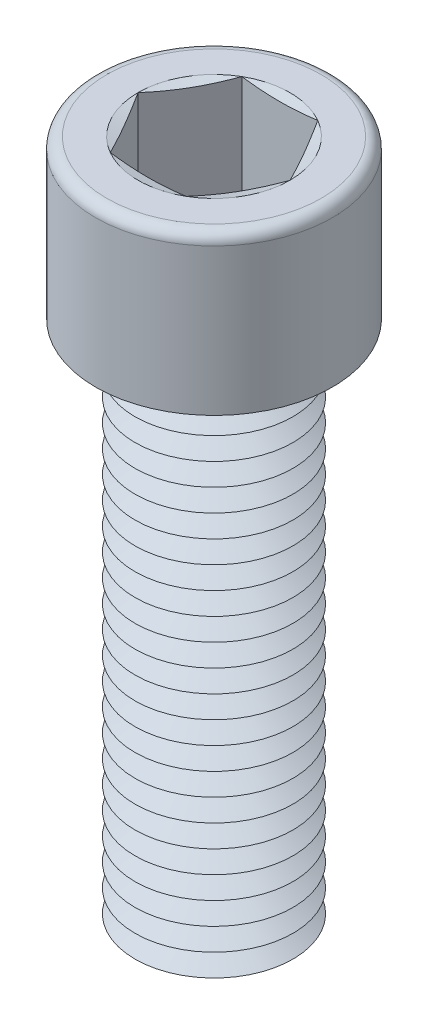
ISO-10303-21;
HEADER;
FILE_DESCRIPTION(('STEP AP214'),'2;1');
FILE_NAME('part.step','',(''),(''),'','','');
FILE_SCHEMA(('AUTOMOTIVE_DESIGN { 1 0 10303 214 1 1 1 1 }'));
ENDSEC;
DATA;
#1=APPLICATION_CONTEXT('core data for automotive mechanical design processes');
#2=APPLICATION_PROTOCOL_DEFINITION('international standard','automotive_design',2000,#1);
#3=PRODUCT_CONTEXT('',#1,'mechanical');
#4=PRODUCT('Part','Part','',(#3));
#5=PRODUCT_RELATED_PRODUCT_CATEGORY('part','',(#4));
#6=PRODUCT_DEFINITION_FORMATION('','',#4);
#7=PRODUCT_DEFINITION_CONTEXT('part definition',#1,'design');
#8=PRODUCT_DEFINITION('design','',#6,#7);
#9=PRODUCT_DEFINITION_SHAPE('','',#8);
#10=(LENGTH_UNIT() NAMED_UNIT(*) SI_UNIT(.MILLI.,.METRE.));
#11=(NAMED_UNIT(*) PLANE_ANGLE_UNIT() SI_UNIT($,.RADIAN.));
#12=(NAMED_UNIT(*) SI_UNIT($,.STERADIAN.) SOLID_ANGLE_UNIT());
#13=UNCERTAINTY_MEASURE_WITH_UNIT(LENGTH_MEASURE(1.E-05),#10,'distance_accuracy_value','');
#14=(GEOMETRIC_REPRESENTATION_CONTEXT(3) GLOBAL_UNCERTAINTY_ASSIGNED_CONTEXT((#13)) GLOBAL_UNIT_ASSIGNED_CONTEXT((#10,
#11,#12)) REPRESENTATION_CONTEXT('',''));
#15=CARTESIAN_POINT('',(0.,0.,0.));
#16=DIRECTION('',(0.,0.,1.));
#17=DIRECTION('',(1.,0.,0.));
#18=AXIS2_PLACEMENT_3D('',#15,#16,#17);
#19=CARTESIAN_POINT('',(0.,6.8,0.));
#20=DIRECTION('',(0.,1.,0.));
#21=DIRECTION('',(0.,0.,1.));
#22=AXIS2_PLACEMENT_3D('',#19,#20,#21);
#23=CONICAL_SURFACE('',#22,4.52775681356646,1.0471975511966);
#24=CARTESIAN_POINT('',(0.,7.65,0.));
#25=DIRECTION('',(0.,1.,0.));
#26=DIRECTION('',(0.,0.,1.));
#27=AXIS2_PLACEMENT_3D('',#24,#25,#26);
#28=CIRCLE('',#27,6.);
#29=CARTESIAN_POINT('',(0.,7.65,6.));
#30=VERTEX_POINT('',#29);
#31=EDGE_CURVE('E502',#30,#30,#28,.T.);
#32=ORIENTED_EDGE('',*,*,#31,.F.);
#33=EDGE_LOOP('',(#32));
#34=FACE_BOUND('',#33,.T.);
#35=CARTESIAN_POINT('',(0.,6.8,0.));
#36=DIRECTION('',(0.,1.,0.));
#37=DIRECTION('',(0.,0.,1.));
#38=AXIS2_PLACEMENT_3D('',#35,#36,#37);
#39=CIRCLE('',#38,4.52775681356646);
#40=CARTESIAN_POINT('',(0.,6.8,4.52775681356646));
#41=VERTEX_POINT('',#40);
#42=EDGE_CURVE('E506',#41,#41,#39,.T.);
#43=ORIENTED_EDGE('',*,*,#42,.T.);
#44=EDGE_LOOP('',(#43));
#45=FACE_BOUND('',#44,.T.);
#46=ADVANCED_FACE('F41',(#34,#45),#23,.T.);
#47=CARTESIAN_POINT('',(0.,5.95,0.));
#48=DIRECTION('',(0.,-1.,0.));
#49=DIRECTION('',(0.,0.,-1.));
#50=AXIS2_PLACEMENT_3D('',#47,#48,#49);
#51=CONICAL_SURFACE('',#50,6.,1.0471975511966);
#52=ORIENTED_EDGE('',*,*,#42,.F.);
#53=EDGE_LOOP('',(#52));
#54=FACE_BOUND('',#53,.T.);
#55=CARTESIAN_POINT('',(0.,5.95,0.));
#56=DIRECTION('',(0.,1.,0.));
#57=DIRECTION('',(0.,0.,1.));
#58=AXIS2_PLACEMENT_3D('',#55,#56,#57);
#59=CIRCLE('',#58,6.);
#60=CARTESIAN_POINT('',(0.,5.95,6.));
#61=VERTEX_POINT('',#60);
#62=EDGE_CURVE('E510',#61,#61,#59,.T.);
#63=ORIENTED_EDGE('',*,*,#62,.T.);
#64=EDGE_LOOP('',(#63));
#65=FACE_BOUND('',#64,.T.);
#66=ADVANCED_FACE('F251',(#54,#65),#51,.T.);
#67=CARTESIAN_POINT('',(0.,0.,0.));
#68=DIRECTION('',(0.,1.,0.));
#69=DIRECTION('',(0.,0.,1.));
#70=AXIS2_PLACEMENT_3D('',#67,#68,#69);
#71=PLANE('',#70);
#72=CARTESIAN_POINT('',(0.,0.,0.));
#73=DIRECTION('',(0.,1.,0.));
#74=DIRECTION('',(0.,0.,1.));
#75=AXIS2_PLACEMENT_3D('',#72,#73,#74);
#76=CIRCLE('',#75,4.52775681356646);
#77=CARTESIAN_POINT('',(0.,0.,4.52775681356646));
#78=VERTEX_POINT('',#77);
#79=EDGE_CURVE('E537',#78,#78,#76,.T.);
#80=ORIENTED_EDGE('',*,*,#79,.F.);
#81=EDGE_LOOP('',(#80));
#82=FACE_BOUND('',#81,.T.);
#83=ADVANCED_FACE('F248',(#82),#71,.F.);
#84=CARTESIAN_POINT('',(0.,0.,0.));
#85=DIRECTION('',(0.,1.,0.));
#86=DIRECTION('',(0.,0.,1.));
#87=AXIS2_PLACEMENT_3D('',#84,#85,#86);
#88=CONICAL_SURFACE('',#87,4.52775681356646,1.0471975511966);
#89=CARTESIAN_POINT('',(0.,0.850000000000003,0.));
#90=DIRECTION('',(0.,1.,0.));
#91=DIRECTION('',(0.,0.,1.));
#92=AXIS2_PLACEMENT_3D('',#89,#90,#91);
#93=CIRCLE('',#92,6.);
#94=CARTESIAN_POINT('',(0.,0.850000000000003,6.));
#95=VERTEX_POINT('',#94);
#96=EDGE_CURVE('E533',#95,#95,#93,.T.);
#97=ORIENTED_EDGE('',*,*,#96,.F.);
#98=EDGE_LOOP('',(#97));
#99=FACE_BOUND('',#98,.T.);
#100=ORIENTED_EDGE('',*,*,#79,.T.);
#101=EDGE_LOOP('',(#100));
#102=FACE_BOUND('',#101,.T.);
#103=ADVANCED_FACE('F250',(#99,#102),#88,.T.);
#104=CARTESIAN_POINT('',(0.,0.850000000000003,0.));
#105=DIRECTION('',(0.,-1.,0.));
#106=DIRECTION('',(0.,0.,-1.));
#107=AXIS2_PLACEMENT_3D('',#104,#105,#106);
#108=CONICAL_SURFACE('',#107,6.,1.0471975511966);
#109=CARTESIAN_POINT('',(0.,1.7,0.));
#110=DIRECTION('',(0.,1.,0.));
#111=DIRECTION('',(0.,0.,1.));
#112=AXIS2_PLACEMENT_3D('',#109,#110,#111);
#113=CIRCLE('',#112,4.52775681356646);
#114=CARTESIAN_POINT('',(0.,1.7,4.52775681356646));
#115=VERTEX_POINT('',#114);
#116=EDGE_CURVE('E529',#115,#115,#113,.T.);
#117=ORIENTED_EDGE('',*,*,#116,.F.);
#118=EDGE_LOOP('',(#117));
#119=FACE_BOUND('',#118,.T.);
#120=ORIENTED_EDGE('',*,*,#96,.T.);
#121=EDGE_LOOP('',(#120));
#122=FACE_BOUND('',#121,.T.);
#123=ADVANCED_FACE('F291',(#119,#122),#108,.T.);
#124=CARTESIAN_POINT('',(0.,1.7,0.));
#125=DIRECTION('',(0.,1.,0.));
#126=DIRECTION('',(0.,0.,1.));
#127=AXIS2_PLACEMENT_3D('',#124,#125,#126);
#128=CONICAL_SURFACE('',#127,4.52775681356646,1.0471975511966);
#129=CARTESIAN_POINT('',(0.,2.55,0.));
#130=DIRECTION('',(0.,1.,0.));
#131=DIRECTION('',(0.,0.,1.));
#132=AXIS2_PLACEMENT_3D('',#129,#130,#131);
#133=CIRCLE('',#132,6.);
#134=CARTESIAN_POINT('',(0.,2.55,6.));
#135=VERTEX_POINT('',#134);
#136=EDGE_CURVE('E526',#135,#135,#133,.T.);
#137=ORIENTED_EDGE('',*,*,#136,.F.);
#138=EDGE_LOOP('',(#137));
#139=FACE_BOUND('',#138,.T.);
#140=ORIENTED_EDGE('',*,*,#116,.T.);
#141=EDGE_LOOP('',(#140));
#142=FACE_BOUND('',#141,.T.);
#143=ADVANCED_FACE('F286',(#139,#142),#128,.T.);
#144=CARTESIAN_POINT('',(0.,2.55,0.));
#145=DIRECTION('',(0.,-1.,0.));
#146=DIRECTION('',(0.,0.,-1.));
#147=AXIS2_PLACEMENT_3D('',#144,#145,#146);
#148=CONICAL_SURFACE('',#147,6.,1.0471975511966);
#149=CARTESIAN_POINT('',(0.,3.4,0.));
#150=DIRECTION('',(0.,1.,0.));
#151=DIRECTION('',(0.,0.,1.));
#152=AXIS2_PLACEMENT_3D('',#149,#150,#151);
#153=CIRCLE('',#152,4.52775681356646);
#154=CARTESIAN_POINT('',(0.,3.4,4.52775681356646));
#155=VERTEX_POINT('',#154);
#156=EDGE_CURVE('E522',#155,#155,#153,.T.);
#157=ORIENTED_EDGE('',*,*,#156,.F.);
#158=EDGE_LOOP('',(#157));
#159=FACE_BOUND('',#158,.T.);
#160=ORIENTED_EDGE('',*,*,#136,.T.);
#161=EDGE_LOOP('',(#160));
#162=FACE_BOUND('',#161,.T.);
#163=ADVANCED_FACE('F283',(#159,#162),#148,.T.);
#164=CARTESIAN_POINT('',(0.,3.4,0.));
#165=DIRECTION('',(0.,1.,0.));
#166=DIRECTION('',(0.,0.,1.));
#167=AXIS2_PLACEMENT_3D('',#164,#165,#166);
#168=CONICAL_SURFACE('',#167,4.52775681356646,1.0471975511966);
#169=CARTESIAN_POINT('',(0.,4.25,0.));
#170=DIRECTION('',(0.,1.,0.));
#171=DIRECTION('',(0.,0.,1.));
#172=AXIS2_PLACEMENT_3D('',#169,#170,#171);
#173=CIRCLE('',#172,6.);
#174=CARTESIAN_POINT('',(0.,4.25,6.));
#175=VERTEX_POINT('',#174);
#176=EDGE_CURVE('E518',#175,#175,#173,.T.);
#177=ORIENTED_EDGE('',*,*,#176,.F.);
#178=EDGE_LOOP('',(#177));
#179=FACE_BOUND('',#178,.T.);
#180=ORIENTED_EDGE('',*,*,#156,.T.);
#181=EDGE_LOOP('',(#180));
#182=FACE_BOUND('',#181,.T.);
#183=ADVANCED_FACE('F277',(#179,#182),#168,.T.);
#184=CARTESIAN_POINT('',(0.,4.25,0.));
#185=DIRECTION('',(0.,-1.,0.));
#186=DIRECTION('',(0.,0.,-1.));
#187=AXIS2_PLACEMENT_3D('',#184,#185,#186);
#188=CONICAL_SURFACE('',#187,6.,1.0471975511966);
#189=CARTESIAN_POINT('',(0.,5.1,0.));
#190=DIRECTION('',(0.,1.,0.));
#191=DIRECTION('',(0.,0.,1.));
#192=AXIS2_PLACEMENT_3D('',#189,#190,#191);
#193=CIRCLE('',#192,4.52775681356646);
#194=CARTESIAN_POINT('',(0.,5.1,4.52775681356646));
#195=VERTEX_POINT('',#194);
#196=EDGE_CURVE('E514',#195,#195,#193,.T.);
#197=ORIENTED_EDGE('',*,*,#196,.F.);
#198=EDGE_LOOP('',(#197));
#199=FACE_BOUND('',#198,.T.);
#200=ORIENTED_EDGE('',*,*,#176,.T.);
#201=EDGE_LOOP('',(#200));
#202=FACE_BOUND('',#201,.T.);
#203=ADVANCED_FACE('F273',(#199,#202),#188,.T.);
#204=CARTESIAN_POINT('',(0.,5.1,0.));
#205=DIRECTION('',(0.,1.,0.));
#206=DIRECTION('',(0.,0.,1.));
#207=AXIS2_PLACEMENT_3D('',#204,#205,#206);
#208=CONICAL_SURFACE('',#207,4.52775681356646,1.0471975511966);
#209=ORIENTED_EDGE('',*,*,#62,.F.);
#210=EDGE_LOOP('',(#209));
#211=FACE_BOUND('',#210,.T.);
#212=ORIENTED_EDGE('',*,*,#196,.T.);
#213=EDGE_LOOP('',(#212));
#214=FACE_BOUND('',#213,.T.);
#215=ADVANCED_FACE('F276',(#211,#214),#208,.T.);
#216=CARTESIAN_POINT('',(0.,8.5,0.));
#217=DIRECTION('',(0.,1.,0.));
#218=DIRECTION('',(0.,0.,1.));
#219=AXIS2_PLACEMENT_3D('',#216,#217,#218);
#220=CONICAL_SURFACE('',#219,4.52775681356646,1.0471975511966);
#221=CARTESIAN_POINT('',(0.,9.35,0.));
#222=DIRECTION('',(0.,1.,0.));
#223=DIRECTION('',(0.,0.,1.));
#224=AXIS2_PLACEMENT_3D('',#221,#222,#223);
#225=CIRCLE('',#224,6.);
#226=CARTESIAN_POINT('',(0.,9.35,6.));
#227=VERTEX_POINT('',#226);
#228=EDGE_CURVE('E494',#227,#227,#225,.T.);
#229=ORIENTED_EDGE('',*,*,#228,.F.);
#230=EDGE_LOOP('',(#229));
#231=FACE_BOUND('',#230,.T.);
#232=CARTESIAN_POINT('',(0.,8.5,0.));
#233=DIRECTION('',(0.,1.,0.));
#234=DIRECTION('',(0.,0.,1.));
#235=AXIS2_PLACEMENT_3D('',#232,#233,#234);
#236=CIRCLE('',#235,4.52775681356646);
#237=CARTESIAN_POINT('',(0.,8.5,4.52775681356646));
#238=VERTEX_POINT('',#237);
#239=EDGE_CURVE('E498',#238,#238,#236,.T.);
#240=ORIENTED_EDGE('',*,*,#239,.T.);
#241=EDGE_LOOP('',(#240));
#242=FACE_BOUND('',#241,.T.);
#243=ADVANCED_FACE('F281',(#231,#242),#220,.T.);
#244=CARTESIAN_POINT('',(0.,7.65,0.));
#245=DIRECTION('',(0.,-1.,0.));
#246=DIRECTION('',(0.,0.,-1.));
#247=AXIS2_PLACEMENT_3D('',#244,#245,#246);
#248=CONICAL_SURFACE('',#247,6.,1.0471975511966);
#249=ORIENTED_EDGE('',*,*,#239,.F.);
#250=EDGE_LOOP('',(#249));
#251=FACE_BOUND('',#250,.T.);
#252=ORIENTED_EDGE('',*,*,#31,.T.);
#253=EDGE_LOOP('',(#252));
#254=FACE_BOUND('',#253,.T.);
#255=ADVANCED_FACE('F976',(#251,#254),#248,.T.);
#256=CARTESIAN_POINT('',(0.,10.2,0.));
#257=DIRECTION('',(0.,1.,0.));
#258=DIRECTION('',(0.,0.,1.));
#259=AXIS2_PLACEMENT_3D('',#256,#257,#258);
#260=CONICAL_SURFACE('',#259,4.52775681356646,1.0471975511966);
#261=CARTESIAN_POINT('',(0.,11.05,0.));
#262=DIRECTION('',(0.,1.,0.));
#263=DIRECTION('',(0.,0.,1.));
#264=AXIS2_PLACEMENT_3D('',#261,#262,#263);
#265=CIRCLE('',#264,6.);
#266=CARTESIAN_POINT('',(0.,11.05,6.));
#267=VERTEX_POINT('',#266);
#268=EDGE_CURVE('E486',#267,#267,#265,.T.);
#269=ORIENTED_EDGE('',*,*,#268,.F.);
#270=EDGE_LOOP('',(#269));
#271=FACE_BOUND('',#270,.T.);
#272=CARTESIAN_POINT('',(0.,10.2,0.));
#273=DIRECTION('',(0.,1.,0.));
#274=DIRECTION('',(0.,0.,1.));
#275=AXIS2_PLACEMENT_3D('',#272,#273,#274);
#276=CIRCLE('',#275,4.52775681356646);
#277=CARTESIAN_POINT('',(0.,10.2,4.52775681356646));
#278=VERTEX_POINT('',#277);
#279=EDGE_CURVE('E490',#278,#278,#276,.T.);
#280=ORIENTED_EDGE('',*,*,#279,.T.);
#281=EDGE_LOOP('',(#280));
#282=FACE_BOUND('',#281,.T.);
#283=ADVANCED_FACE('F967',(#271,#282),#260,.T.);
#284=CARTESIAN_POINT('',(0.,9.35,0.));
#285=DIRECTION('',(0.,-1.,0.));
#286=DIRECTION('',(0.,0.,-1.));
#287=AXIS2_PLACEMENT_3D('',#284,#285,#286);
#288=CONICAL_SURFACE('',#287,6.,1.0471975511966);
#289=ORIENTED_EDGE('',*,*,#279,.F.);
#290=EDGE_LOOP('',(#289));
#291=FACE_BOUND('',#290,.T.);
#292=ORIENTED_EDGE('',*,*,#228,.T.);
#293=EDGE_LOOP('',(#292));
#294=FACE_BOUND('',#293,.T.);
#295=ADVANCED_FACE('F958',(#291,#294),#288,.T.);
#296=CARTESIAN_POINT('',(0.,11.9,0.));
#297=DIRECTION('',(0.,1.,0.));
#298=DIRECTION('',(0.,0.,1.));
#299=AXIS2_PLACEMENT_3D('',#296,#297,#298);
#300=CONICAL_SURFACE('',#299,4.52775681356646,1.0471975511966);
#301=CARTESIAN_POINT('',(0.,12.75,0.));
#302=DIRECTION('',(0.,1.,0.));
#303=DIRECTION('',(0.,0.,1.));
#304=AXIS2_PLACEMENT_3D('',#301,#302,#303);
#305=CIRCLE('',#304,6.);
#306=CARTESIAN_POINT('',(0.,12.75,6.));
#307=VERTEX_POINT('',#306);
#308=EDGE_CURVE('E478',#307,#307,#305,.T.);
#309=ORIENTED_EDGE('',*,*,#308,.F.);
#310=EDGE_LOOP('',(#309));
#311=FACE_BOUND('',#310,.T.);
#312=CARTESIAN_POINT('',(0.,11.9,0.));
#313=DIRECTION('',(0.,1.,0.));
#314=DIRECTION('',(0.,0.,1.));
#315=AXIS2_PLACEMENT_3D('',#312,#313,#314);
#316=CIRCLE('',#315,4.52775681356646);
#317=CARTESIAN_POINT('',(0.,11.9,4.52775681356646));
#318=VERTEX_POINT('',#317);
#319=EDGE_CURVE('E482',#318,#318,#316,.T.);
#320=ORIENTED_EDGE('',*,*,#319,.T.);
#321=EDGE_LOOP('',(#320));
#322=FACE_BOUND('',#321,.T.);
#323=ADVANCED_FACE('F949',(#311,#322),#300,.T.);
#324=CARTESIAN_POINT('',(0.,11.05,0.));
#325=DIRECTION('',(0.,-1.,0.));
#326=DIRECTION('',(0.,0.,-1.));
#327=AXIS2_PLACEMENT_3D('',#324,#325,#326);
#328=CONICAL_SURFACE('',#327,6.,1.0471975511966);
#329=ORIENTED_EDGE('',*,*,#319,.F.);
#330=EDGE_LOOP('',(#329));
#331=FACE_BOUND('',#330,.T.);
#332=ORIENTED_EDGE('',*,*,#268,.T.);
#333=EDGE_LOOP('',(#332));
#334=FACE_BOUND('',#333,.T.);
#335=ADVANCED_FACE('F940',(#331,#334),#328,.T.);
#336=CARTESIAN_POINT('',(0.,13.6,0.));
#337=DIRECTION('',(0.,1.,0.));
#338=DIRECTION('',(0.,0.,1.));
#339=AXIS2_PLACEMENT_3D('',#336,#337,#338);
#340=CONICAL_SURFACE('',#339,4.52775681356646,1.0471975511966);
#341=CARTESIAN_POINT('',(0.,14.45,0.));
#342=DIRECTION('',(0.,1.,0.));
#343=DIRECTION('',(0.,0.,1.));
#344=AXIS2_PLACEMENT_3D('',#341,#342,#343);
#345=CIRCLE('',#344,6.);
#346=CARTESIAN_POINT('',(0.,14.45,6.));
#347=VERTEX_POINT('',#346);
#348=EDGE_CURVE('E470',#347,#347,#345,.T.);
#349=ORIENTED_EDGE('',*,*,#348,.F.);
#350=EDGE_LOOP('',(#349));
#351=FACE_BOUND('',#350,.T.);
#352=CARTESIAN_POINT('',(0.,13.6,0.));
#353=DIRECTION('',(0.,1.,0.));
#354=DIRECTION('',(0.,0.,1.));
#355=AXIS2_PLACEMENT_3D('',#352,#353,#354);
#356=CIRCLE('',#355,4.52775681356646);
#357=CARTESIAN_POINT('',(0.,13.6,4.52775681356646));
#358=VERTEX_POINT('',#357);
#359=EDGE_CURVE('E474',#358,#358,#356,.T.);
#360=ORIENTED_EDGE('',*,*,#359,.T.);
#361=EDGE_LOOP('',(#360));
#362=FACE_BOUND('',#361,.T.);
#363=ADVANCED_FACE('F931',(#351,#362),#340,.T.);
#364=CARTESIAN_POINT('',(0.,12.75,0.));
#365=DIRECTION('',(0.,-1.,0.));
#366=DIRECTION('',(0.,0.,-1.));
#367=AXIS2_PLACEMENT_3D('',#364,#365,#366);
#368=CONICAL_SURFACE('',#367,6.,1.0471975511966);
#369=ORIENTED_EDGE('',*,*,#359,.F.);
#370=EDGE_LOOP('',(#369));
#371=FACE_BOUND('',#370,.T.);
#372=ORIENTED_EDGE('',*,*,#308,.T.);
#373=EDGE_LOOP('',(#372));
#374=FACE_BOUND('',#373,.T.);
#375=ADVANCED_FACE('F922',(#371,#374),#368,.T.);
#376=CARTESIAN_POINT('',(0.,15.3,0.));
#377=DIRECTION('',(0.,1.,0.));
#378=DIRECTION('',(0.,0.,1.));
#379=AXIS2_PLACEMENT_3D('',#376,#377,#378);
#380=CONICAL_SURFACE('',#379,4.52775681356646,1.0471975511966);
#381=CARTESIAN_POINT('',(0.,16.15,0.));
#382=DIRECTION('',(0.,1.,0.));
#383=DIRECTION('',(0.,0.,1.));
#384=AXIS2_PLACEMENT_3D('',#381,#382,#383);
#385=CIRCLE('',#384,6.);
#386=CARTESIAN_POINT('',(0.,16.15,6.));
#387=VERTEX_POINT('',#386);
#388=EDGE_CURVE('E462',#387,#387,#385,.T.);
#389=ORIENTED_EDGE('',*,*,#388,.F.);
#390=EDGE_LOOP('',(#389));
#391=FACE_BOUND('',#390,.T.);
#392=CARTESIAN_POINT('',(0.,15.3,0.));
#393=DIRECTION('',(0.,1.,0.));
#394=DIRECTION('',(0.,0.,1.));
#395=AXIS2_PLACEMENT_3D('',#392,#393,#394);
#396=CIRCLE('',#395,4.52775681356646);
#397=CARTESIAN_POINT('',(0.,15.3,4.52775681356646));
#398=VERTEX_POINT('',#397);
#399=EDGE_CURVE('E466',#398,#398,#396,.T.);
#400=ORIENTED_EDGE('',*,*,#399,.T.);
#401=EDGE_LOOP('',(#400));
#402=FACE_BOUND('',#401,.T.);
#403=ADVANCED_FACE('F913',(#391,#402),#380,.T.);
#404=CARTESIAN_POINT('',(0.,14.45,0.));
#405=DIRECTION('',(0.,-1.,0.));
#406=DIRECTION('',(0.,0.,-1.));
#407=AXIS2_PLACEMENT_3D('',#404,#405,#406);
#408=CONICAL_SURFACE('',#407,6.,1.0471975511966);
#409=ORIENTED_EDGE('',*,*,#399,.F.);
#410=EDGE_LOOP('',(#409));
#411=FACE_BOUND('',#410,.T.);
#412=ORIENTED_EDGE('',*,*,#348,.T.);
#413=EDGE_LOOP('',(#412));
#414=FACE_BOUND('',#413,.T.);
#415=ADVANCED_FACE('F904',(#411,#414),#408,.T.);
#416=CARTESIAN_POINT('',(0.,17.,0.));
#417=DIRECTION('',(0.,1.,0.));
#418=DIRECTION('',(0.,0.,1.));
#419=AXIS2_PLACEMENT_3D('',#416,#417,#418);
#420=CONICAL_SURFACE('',#419,4.52775681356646,1.0471975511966);
#421=CARTESIAN_POINT('',(0.,17.85,0.));
#422=DIRECTION('',(0.,1.,0.));
#423=DIRECTION('',(0.,0.,1.));
#424=AXIS2_PLACEMENT_3D('',#421,#422,#423);
#425=CIRCLE('',#424,6.);
#426=CARTESIAN_POINT('',(0.,17.85,6.));
#427=VERTEX_POINT('',#426);
#428=EDGE_CURVE('E454',#427,#427,#425,.T.);
#429=ORIENTED_EDGE('',*,*,#428,.F.);
#430=EDGE_LOOP('',(#429));
#431=FACE_BOUND('',#430,.T.);
#432=CARTESIAN_POINT('',(0.,17.,0.));
#433=DIRECTION('',(0.,1.,0.));
#434=DIRECTION('',(0.,0.,1.));
#435=AXIS2_PLACEMENT_3D('',#432,#433,#434);
#436=CIRCLE('',#435,4.52775681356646);
#437=CARTESIAN_POINT('',(0.,17.,4.52775681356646));
#438=VERTEX_POINT('',#437);
#439=EDGE_CURVE('E458',#438,#438,#436,.T.);
#440=ORIENTED_EDGE('',*,*,#439,.T.);
#441=EDGE_LOOP('',(#440));
#442=FACE_BOUND('',#441,.T.);
#443=ADVANCED_FACE('F895',(#431,#442),#420,.T.);
#444=CARTESIAN_POINT('',(0.,16.15,0.));
#445=DIRECTION('',(0.,-1.,0.));
#446=DIRECTION('',(0.,0.,-1.));
#447=AXIS2_PLACEMENT_3D('',#444,#445,#446);
#448=CONICAL_SURFACE('',#447,6.,1.0471975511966);
#449=ORIENTED_EDGE('',*,*,#439,.F.);
#450=EDGE_LOOP('',(#449));
#451=FACE_BOUND('',#450,.T.);
#452=ORIENTED_EDGE('',*,*,#388,.T.);
#453=EDGE_LOOP('',(#452));
#454=FACE_BOUND('',#453,.T.);
#455=ADVANCED_FACE('F886',(#451,#454),#448,.T.);
#456=CARTESIAN_POINT('',(0.,18.7,0.));
#457=DIRECTION('',(0.,1.,0.));
#458=DIRECTION('',(0.,0.,1.));
#459=AXIS2_PLACEMENT_3D('',#456,#457,#458);
#460=CONICAL_SURFACE('',#459,4.52775681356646,1.0471975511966);
#461=CARTESIAN_POINT('',(0.,19.55,0.));
#462=DIRECTION('',(0.,1.,0.));
#463=DIRECTION('',(0.,0.,1.));
#464=AXIS2_PLACEMENT_3D('',#461,#462,#463);
#465=CIRCLE('',#464,6.);
#466=CARTESIAN_POINT('',(0.,19.55,6.));
#467=VERTEX_POINT('',#466);
#468=EDGE_CURVE('E446',#467,#467,#465,.T.);
#469=ORIENTED_EDGE('',*,*,#468,.F.);
#470=EDGE_LOOP('',(#469));
#471=FACE_BOUND('',#470,.T.);
#472=CARTESIAN_POINT('',(0.,18.7,0.));
#473=DIRECTION('',(0.,1.,0.));
#474=DIRECTION('',(0.,0.,1.));
#475=AXIS2_PLACEMENT_3D('',#472,#473,#474);
#476=CIRCLE('',#475,4.52775681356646);
#477=CARTESIAN_POINT('',(0.,18.7,4.52775681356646));
#478=VERTEX_POINT('',#477);
#479=EDGE_CURVE('E450',#478,#478,#476,.T.);
#480=ORIENTED_EDGE('',*,*,#479,.T.);
#481=EDGE_LOOP('',(#480));
#482=FACE_BOUND('',#481,.T.);
#483=ADVANCED_FACE('F877',(#471,#482),#460,.T.);
#484=CARTESIAN_POINT('',(0.,17.85,0.));
#485=DIRECTION('',(0.,-1.,0.));
#486=DIRECTION('',(0.,0.,-1.));
#487=AXIS2_PLACEMENT_3D('',#484,#485,#486);
#488=CONICAL_SURFACE('',#487,6.,1.0471975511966);
#489=ORIENTED_EDGE('',*,*,#479,.F.);
#490=EDGE_LOOP('',(#489));
#491=FACE_BOUND('',#490,.T.);
#492=ORIENTED_EDGE('',*,*,#428,.T.);
#493=EDGE_LOOP('',(#492));
#494=FACE_BOUND('',#493,.T.);
#495=ADVANCED_FACE('F868',(#491,#494),#488,.T.);
#496=CARTESIAN_POINT('',(0.,20.4,0.));
#497=DIRECTION('',(0.,1.,0.));
#498=DIRECTION('',(0.,0.,1.));
#499=AXIS2_PLACEMENT_3D('',#496,#497,#498);
#500=CONICAL_SURFACE('',#499,4.52775681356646,1.0471975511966);
#501=CARTESIAN_POINT('',(0.,21.25,0.));
#502=DIRECTION('',(0.,1.,0.));
#503=DIRECTION('',(0.,0.,1.));
#504=AXIS2_PLACEMENT_3D('',#501,#502,#503);
#505=CIRCLE('',#504,6.);
#506=CARTESIAN_POINT('',(0.,21.25,6.));
#507=VERTEX_POINT('',#506);
#508=EDGE_CURVE('E439',#507,#507,#505,.T.);
#509=ORIENTED_EDGE('',*,*,#508,.F.);
#510=EDGE_LOOP('',(#509));
#511=FACE_BOUND('',#510,.T.);
#512=CARTESIAN_POINT('',(0.,20.4,0.));
#513=DIRECTION('',(0.,1.,0.));
#514=DIRECTION('',(0.,0.,1.));
#515=AXIS2_PLACEMENT_3D('',#512,#513,#514);
#516=CIRCLE('',#515,4.52775681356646);
#517=CARTESIAN_POINT('',(0.,20.4,4.52775681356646));
#518=VERTEX_POINT('',#517);
#519=EDGE_CURVE('E443',#518,#518,#516,.T.);
#520=ORIENTED_EDGE('',*,*,#519,.T.);
#521=EDGE_LOOP('',(#520));
#522=FACE_BOUND('',#521,.T.);
#523=ADVANCED_FACE('F859',(#511,#522),#500,.T.);
#524=CARTESIAN_POINT('',(0.,19.55,0.));
#525=DIRECTION('',(0.,-1.,0.));
#526=DIRECTION('',(0.,0.,-1.));
#527=AXIS2_PLACEMENT_3D('',#524,#525,#526);
#528=CONICAL_SURFACE('',#527,6.,1.0471975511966);
#529=ORIENTED_EDGE('',*,*,#519,.F.);
#530=EDGE_LOOP('',(#529));
#531=FACE_BOUND('',#530,.T.);
#532=ORIENTED_EDGE('',*,*,#468,.T.);
#533=EDGE_LOOP('',(#532));
#534=FACE_BOUND('',#533,.T.);
#535=ADVANCED_FACE('F850',(#531,#534),#528,.T.);
#536=CARTESIAN_POINT('',(0.,22.1,0.));
#537=DIRECTION('',(0.,1.,0.));
#538=DIRECTION('',(0.,0.,1.));
#539=AXIS2_PLACEMENT_3D('',#536,#537,#538);
#540=CONICAL_SURFACE('',#539,4.52775681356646,1.0471975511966);
#541=CARTESIAN_POINT('',(0.,22.95,0.));
#542=DIRECTION('',(0.,1.,0.));
#543=DIRECTION('',(0.,0.,1.));
#544=AXIS2_PLACEMENT_3D('',#541,#542,#543);
#545=CIRCLE('',#544,6.);
#546=CARTESIAN_POINT('',(0.,22.95,6.));
#547=VERTEX_POINT('',#546);
#548=EDGE_CURVE('E431',#547,#547,#545,.T.);
#549=ORIENTED_EDGE('',*,*,#548,.F.);
#550=EDGE_LOOP('',(#549));
#551=FACE_BOUND('',#550,.T.);
#552=CARTESIAN_POINT('',(0.,22.1,0.));
#553=DIRECTION('',(0.,1.,0.));
#554=DIRECTION('',(0.,0.,1.));
#555=AXIS2_PLACEMENT_3D('',#552,#553,#554);
#556=CIRCLE('',#555,4.52775681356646);
#557=CARTESIAN_POINT('',(0.,22.1,4.52775681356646));
#558=VERTEX_POINT('',#557);
#559=EDGE_CURVE('E435',#558,#558,#556,.T.);
#560=ORIENTED_EDGE('',*,*,#559,.T.);
#561=EDGE_LOOP('',(#560));
#562=FACE_BOUND('',#561,.T.);
#563=ADVANCED_FACE('F841',(#551,#562),#540,.T.);
#564=CARTESIAN_POINT('',(0.,21.25,0.));
#565=DIRECTION('',(0.,-1.,0.));
#566=DIRECTION('',(0.,0.,-1.));
#567=AXIS2_PLACEMENT_3D('',#564,#565,#566);
#568=CONICAL_SURFACE('',#567,6.,1.0471975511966);
#569=ORIENTED_EDGE('',*,*,#559,.F.);
#570=EDGE_LOOP('',(#569));
#571=FACE_BOUND('',#570,.T.);
#572=ORIENTED_EDGE('',*,*,#508,.T.);
#573=EDGE_LOOP('',(#572));
#574=FACE_BOUND('',#573,.T.);
#575=ADVANCED_FACE('F832',(#571,#574),#568,.T.);
#576=CARTESIAN_POINT('',(0.,23.8,0.));
#577=DIRECTION('',(0.,1.,0.));
#578=DIRECTION('',(0.,0.,1.));
#579=AXIS2_PLACEMENT_3D('',#576,#577,#578);
#580=CONICAL_SURFACE('',#579,4.52775681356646,1.0471975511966);
#581=CARTESIAN_POINT('',(0.,24.65,0.));
#582=DIRECTION('',(0.,1.,0.));
#583=DIRECTION('',(0.,0.,1.));
#584=AXIS2_PLACEMENT_3D('',#581,#582,#583);
#585=CIRCLE('',#584,6.);
#586=CARTESIAN_POINT('',(0.,24.65,6.));
#587=VERTEX_POINT('',#586);
#588=EDGE_CURVE('E423',#587,#587,#585,.T.);
#589=ORIENTED_EDGE('',*,*,#588,.F.);
#590=EDGE_LOOP('',(#589));
#591=FACE_BOUND('',#590,.T.);
#592=CARTESIAN_POINT('',(0.,23.8,0.));
#593=DIRECTION('',(0.,1.,0.));
#594=DIRECTION('',(0.,0.,1.));
#595=AXIS2_PLACEMENT_3D('',#592,#593,#594);
#596=CIRCLE('',#595,4.52775681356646);
#597=CARTESIAN_POINT('',(0.,23.8,4.52775681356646));
#598=VERTEX_POINT('',#597);
#599=EDGE_CURVE('E427',#598,#598,#596,.T.);
#600=ORIENTED_EDGE('',*,*,#599,.T.);
#601=EDGE_LOOP('',(#600));
#602=FACE_BOUND('',#601,.T.);
#603=ADVANCED_FACE('F823',(#591,#602),#580,.T.);
#604=CARTESIAN_POINT('',(0.,22.95,0.));
#605=DIRECTION('',(0.,-1.,0.));
#606=DIRECTION('',(0.,0.,-1.));
#607=AXIS2_PLACEMENT_3D('',#604,#605,#606);
#608=CONICAL_SURFACE('',#607,6.,1.0471975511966);
#609=ORIENTED_EDGE('',*,*,#599,.F.);
#610=EDGE_LOOP('',(#609));
#611=FACE_BOUND('',#610,.T.);
#612=ORIENTED_EDGE('',*,*,#548,.T.);
#613=EDGE_LOOP('',(#612));
#614=FACE_BOUND('',#613,.T.);
#615=ADVANCED_FACE('F814',(#611,#614),#608,.T.);
#616=CARTESIAN_POINT('',(0.,25.5,0.));
#617=DIRECTION('',(0.,1.,0.));
#618=DIRECTION('',(0.,0.,1.));
#619=AXIS2_PLACEMENT_3D('',#616,#617,#618);
#620=CONICAL_SURFACE('',#619,4.52775681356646,1.0471975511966);
#621=CARTESIAN_POINT('',(0.,26.35,0.));
#622=DIRECTION('',(0.,1.,0.));
#623=DIRECTION('',(0.,0.,1.));
#624=AXIS2_PLACEMENT_3D('',#621,#622,#623);
#625=CIRCLE('',#624,6.);
#626=CARTESIAN_POINT('',(0.,26.35,6.));
#627=VERTEX_POINT('',#626);
#628=EDGE_CURVE('E415',#627,#627,#625,.T.);
#629=ORIENTED_EDGE('',*,*,#628,.F.);
#630=EDGE_LOOP('',(#629));
#631=FACE_BOUND('',#630,.T.);
#632=CARTESIAN_POINT('',(0.,25.5,0.));
#633=DIRECTION('',(0.,1.,0.));
#634=DIRECTION('',(0.,0.,1.));
#635=AXIS2_PLACEMENT_3D('',#632,#633,#634);
#636=CIRCLE('',#635,4.52775681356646);
#637=CARTESIAN_POINT('',(0.,25.5,4.52775681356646));
#638=VERTEX_POINT('',#637);
#639=EDGE_CURVE('E419',#638,#638,#636,.T.);
#640=ORIENTED_EDGE('',*,*,#639,.T.);
#641=EDGE_LOOP('',(#640));
#642=FACE_BOUND('',#641,.T.);
#643=ADVANCED_FACE('F805',(#631,#642),#620,.T.);
#644=CARTESIAN_POINT('',(0.,24.65,0.));
#645=DIRECTION('',(0.,-1.,0.));
#646=DIRECTION('',(0.,0.,-1.));
#647=AXIS2_PLACEMENT_3D('',#644,#645,#646);
#648=CONICAL_SURFACE('',#647,6.,1.0471975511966);
#649=ORIENTED_EDGE('',*,*,#639,.F.);
#650=EDGE_LOOP('',(#649));
#651=FACE_BOUND('',#650,.T.);
#652=ORIENTED_EDGE('',*,*,#588,.T.);
#653=EDGE_LOOP('',(#652));
#654=FACE_BOUND('',#653,.T.);
#655=ADVANCED_FACE('F796',(#651,#654),#648,.T.);
#656=CARTESIAN_POINT('',(0.,27.2,0.));
#657=DIRECTION('',(0.,1.,0.));
#658=DIRECTION('',(0.,0.,1.));
#659=AXIS2_PLACEMENT_3D('',#656,#657,#658);
#660=CONICAL_SURFACE('',#659,4.52775681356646,1.0471975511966);
#661=CARTESIAN_POINT('',(0.,28.05,0.));
#662=DIRECTION('',(0.,1.,0.));
#663=DIRECTION('',(0.,0.,1.));
#664=AXIS2_PLACEMENT_3D('',#661,#662,#663);
#665=CIRCLE('',#664,6.);
#666=CARTESIAN_POINT('',(0.,28.05,6.));
#667=VERTEX_POINT('',#666);
#668=EDGE_CURVE('E407',#667,#667,#665,.T.);
#669=ORIENTED_EDGE('',*,*,#668,.F.);
#670=EDGE_LOOP('',(#669));
#671=FACE_BOUND('',#670,.T.);
#672=CARTESIAN_POINT('',(0.,27.2,0.));
#673=DIRECTION('',(0.,1.,0.));
#674=DIRECTION('',(0.,0.,1.));
#675=AXIS2_PLACEMENT_3D('',#672,#673,#674);
#676=CIRCLE('',#675,4.52775681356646);
#677=CARTESIAN_POINT('',(0.,27.2,4.52775681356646));
#678=VERTEX_POINT('',#677);
#679=EDGE_CURVE('E411',#678,#678,#676,.T.);
#680=ORIENTED_EDGE('',*,*,#679,.T.);
#681=EDGE_LOOP('',(#680));
#682=FACE_BOUND('',#681,.T.);
#683=ADVANCED_FACE('F787',(#671,#682),#660,.T.);
#684=CARTESIAN_POINT('',(0.,26.35,0.));
#685=DIRECTION('',(0.,-1.,0.));
#686=DIRECTION('',(0.,0.,-1.));
#687=AXIS2_PLACEMENT_3D('',#684,#685,#686);
#688=CONICAL_SURFACE('',#687,6.,1.0471975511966);
#689=ORIENTED_EDGE('',*,*,#679,.F.);
#690=EDGE_LOOP('',(#689));
#691=FACE_BOUND('',#690,.T.);
#692=ORIENTED_EDGE('',*,*,#628,.T.);
#693=EDGE_LOOP('',(#692));
#694=FACE_BOUND('',#693,.T.);
#695=ADVANCED_FACE('F778',(#691,#694),#688,.T.);
#696=CARTESIAN_POINT('',(0.,28.9,0.));
#697=DIRECTION('',(0.,1.,0.));
#698=DIRECTION('',(0.,0.,1.));
#699=AXIS2_PLACEMENT_3D('',#696,#697,#698);
#700=CONICAL_SURFACE('',#699,4.52775681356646,1.0471975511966);
#701=CARTESIAN_POINT('',(0.,29.75,0.));
#702=DIRECTION('',(0.,1.,0.));
#703=DIRECTION('',(0.,0.,1.));
#704=AXIS2_PLACEMENT_3D('',#701,#702,#703);
#705=CIRCLE('',#704,6.);
#706=CARTESIAN_POINT('',(0.,29.75,6.));
#707=VERTEX_POINT('',#706);
#708=EDGE_CURVE('E399',#707,#707,#705,.T.);
#709=ORIENTED_EDGE('',*,*,#708,.F.);
#710=EDGE_LOOP('',(#709));
#711=FACE_BOUND('',#710,.T.);
#712=CARTESIAN_POINT('',(0.,28.9,0.));
#713=DIRECTION('',(0.,1.,0.));
#714=DIRECTION('',(0.,0.,1.));
#715=AXIS2_PLACEMENT_3D('',#712,#713,#714);
#716=CIRCLE('',#715,4.52775681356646);
#717=CARTESIAN_POINT('',(0.,28.9,4.52775681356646));
#718=VERTEX_POINT('',#717);
#719=EDGE_CURVE('E403',#718,#718,#716,.T.);
#720=ORIENTED_EDGE('',*,*,#719,.T.);
#721=EDGE_LOOP('',(#720));
#722=FACE_BOUND('',#721,.T.);
#723=ADVANCED_FACE('F769',(#711,#722),#700,.T.);
#724=CARTESIAN_POINT('',(0.,28.05,0.));
#725=DIRECTION('',(0.,-1.,0.));
#726=DIRECTION('',(0.,0.,-1.));
#727=AXIS2_PLACEMENT_3D('',#724,#725,#726);
#728=CONICAL_SURFACE('',#727,6.,1.0471975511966);
#729=ORIENTED_EDGE('',*,*,#719,.F.);
#730=EDGE_LOOP('',(#729));
#731=FACE_BOUND('',#730,.T.);
#732=ORIENTED_EDGE('',*,*,#668,.T.);
#733=EDGE_LOOP('',(#732));
#734=FACE_BOUND('',#733,.T.);
#735=ADVANCED_FACE('F760',(#731,#734),#728,.T.);
#736=CARTESIAN_POINT('',(0.,30.6,0.));
#737=DIRECTION('',(0.,1.,0.));
#738=DIRECTION('',(0.,0.,1.));
#739=AXIS2_PLACEMENT_3D('',#736,#737,#738);
#740=CONICAL_SURFACE('',#739,4.52775681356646,1.0471975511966);
#741=CARTESIAN_POINT('',(0.,31.45,0.));
#742=DIRECTION('',(0.,1.,0.));
#743=DIRECTION('',(0.,0.,1.));
#744=AXIS2_PLACEMENT_3D('',#741,#742,#743);
#745=CIRCLE('',#744,6.);
#746=CARTESIAN_POINT('',(0.,31.45,6.));
#747=VERTEX_POINT('',#746);
#748=EDGE_CURVE('E391',#747,#747,#745,.T.);
#749=ORIENTED_EDGE('',*,*,#748,.F.);
#750=EDGE_LOOP('',(#749));
#751=FACE_BOUND('',#750,.T.);
#752=CARTESIAN_POINT('',(0.,30.6,0.));
#753=DIRECTION('',(0.,1.,0.));
#754=DIRECTION('',(0.,0.,1.));
#755=AXIS2_PLACEMENT_3D('',#752,#753,#754);
#756=CIRCLE('',#755,4.52775681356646);
#757=CARTESIAN_POINT('',(0.,30.6,4.52775681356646));
#758=VERTEX_POINT('',#757);
#759=EDGE_CURVE('E395',#758,#758,#756,.T.);
#760=ORIENTED_EDGE('',*,*,#759,.T.);
#761=EDGE_LOOP('',(#760));
#762=FACE_BOUND('',#761,.T.);
#763=ADVANCED_FACE('F751',(#751,#762),#740,.T.);
#764=CARTESIAN_POINT('',(0.,29.75,0.));
#765=DIRECTION('',(0.,-1.,0.));
#766=DIRECTION('',(0.,0.,-1.));
#767=AXIS2_PLACEMENT_3D('',#764,#765,#766);
#768=CONICAL_SURFACE('',#767,6.,1.0471975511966);
#769=ORIENTED_EDGE('',*,*,#759,.F.);
#770=EDGE_LOOP('',(#769));
#771=FACE_BOUND('',#770,.T.);
#772=ORIENTED_EDGE('',*,*,#708,.T.);
#773=EDGE_LOOP('',(#772));
#774=FACE_BOUND('',#773,.T.);
#775=ADVANCED_FACE('F742',(#771,#774),#768,.T.);
#776=CARTESIAN_POINT('',(0.,32.3,0.));
#777=DIRECTION('',(0.,1.,0.));
#778=DIRECTION('',(0.,0.,1.));
#779=AXIS2_PLACEMENT_3D('',#776,#777,#778);
#780=CONICAL_SURFACE('',#779,4.52775681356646,1.0471975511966);
#781=CARTESIAN_POINT('',(0.,33.15,0.));
#782=DIRECTION('',(0.,1.,0.));
#783=DIRECTION('',(0.,0.,1.));
#784=AXIS2_PLACEMENT_3D('',#781,#782,#783);
#785=CIRCLE('',#784,6.);
#786=CARTESIAN_POINT('',(0.,33.15,6.));
#787=VERTEX_POINT('',#786);
#788=EDGE_CURVE('E383',#787,#787,#785,.T.);
#789=ORIENTED_EDGE('',*,*,#788,.F.);
#790=EDGE_LOOP('',(#789));
#791=FACE_BOUND('',#790,.T.);
#792=CARTESIAN_POINT('',(0.,32.3,0.));
#793=DIRECTION('',(0.,1.,0.));
#794=DIRECTION('',(0.,0.,1.));
#795=AXIS2_PLACEMENT_3D('',#792,#793,#794);
#796=CIRCLE('',#795,4.52775681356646);
#797=CARTESIAN_POINT('',(0.,32.3,4.52775681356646));
#798=VERTEX_POINT('',#797);
#799=EDGE_CURVE('E387',#798,#798,#796,.T.);
#800=ORIENTED_EDGE('',*,*,#799,.T.);
#801=EDGE_LOOP('',(#800));
#802=FACE_BOUND('',#801,.T.);
#803=ADVANCED_FACE('F733',(#791,#802),#780,.T.);
#804=CARTESIAN_POINT('',(0.,31.45,0.));
#805=DIRECTION('',(0.,-1.,0.));
#806=DIRECTION('',(0.,0.,-1.));
#807=AXIS2_PLACEMENT_3D('',#804,#805,#806);
#808=CONICAL_SURFACE('',#807,6.,1.0471975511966);
#809=ORIENTED_EDGE('',*,*,#799,.F.);
#810=EDGE_LOOP('',(#809));
#811=FACE_BOUND('',#810,.T.);
#812=ORIENTED_EDGE('',*,*,#748,.T.);
#813=EDGE_LOOP('',(#812));
#814=FACE_BOUND('',#813,.T.);
#815=ADVANCED_FACE('F724',(#811,#814),#808,.T.);
#816=CARTESIAN_POINT('',(0.,34.,0.));
#817=DIRECTION('',(0.,1.,0.));
#818=DIRECTION('',(0.,0.,1.));
#819=AXIS2_PLACEMENT_3D('',#816,#817,#818);
#820=CONICAL_SURFACE('',#819,4.52775681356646,1.0471975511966);
#821=CARTESIAN_POINT('',(0.,34.85,0.));
#822=DIRECTION('',(0.,1.,0.));
#823=DIRECTION('',(0.,0.,1.));
#824=AXIS2_PLACEMENT_3D('',#821,#822,#823);
#825=CIRCLE('',#824,6.);
#826=CARTESIAN_POINT('',(0.,34.85,6.));
#827=VERTEX_POINT('',#826);
#828=EDGE_CURVE('E376',#827,#827,#825,.T.);
#829=ORIENTED_EDGE('',*,*,#828,.F.);
#830=EDGE_LOOP('',(#829));
#831=FACE_BOUND('',#830,.T.);
#832=CARTESIAN_POINT('',(0.,34.,0.));
#833=DIRECTION('',(0.,1.,0.));
#834=DIRECTION('',(0.,0.,1.));
#835=AXIS2_PLACEMENT_3D('',#832,#833,#834);
#836=CIRCLE('',#835,4.52775681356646);
#837=CARTESIAN_POINT('',(0.,34.,4.52775681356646));
#838=VERTEX_POINT('',#837);
#839=EDGE_CURVE('E380',#838,#838,#836,.T.);
#840=ORIENTED_EDGE('',*,*,#839,.T.);
#841=EDGE_LOOP('',(#840));
#842=FACE_BOUND('',#841,.T.);
#843=ADVANCED_FACE('F715',(#831,#842),#820,.T.);
#844=CARTESIAN_POINT('',(0.,33.15,0.));
#845=DIRECTION('',(0.,-1.,0.));
#846=DIRECTION('',(0.,0.,-1.));
#847=AXIS2_PLACEMENT_3D('',#844,#845,#846);
#848=CONICAL_SURFACE('',#847,6.,1.0471975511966);
#849=ORIENTED_EDGE('',*,*,#839,.F.);
#850=EDGE_LOOP('',(#849));
#851=FACE_BOUND('',#850,.T.);
#852=ORIENTED_EDGE('',*,*,#788,.T.);
#853=EDGE_LOOP('',(#852));
#854=FACE_BOUND('',#853,.T.);
#855=ADVANCED_FACE('F706',(#851,#854),#848,.T.);
#856=CARTESIAN_POINT('',(0.,35.7,0.));
#857=DIRECTION('',(0.,1.,0.));
#858=DIRECTION('',(0.,0.,1.));
#859=AXIS2_PLACEMENT_3D('',#856,#857,#858);
#860=CONICAL_SURFACE('',#859,4.52775681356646,1.0471975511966);
#861=CARTESIAN_POINT('',(0.,36.55,0.));
#862=DIRECTION('',(0.,1.,0.));
#863=DIRECTION('',(0.,0.,1.));
#864=AXIS2_PLACEMENT_3D('',#861,#862,#863);
#865=CIRCLE('',#864,6.);
#866=CARTESIAN_POINT('',(0.,36.55,6.));
#867=VERTEX_POINT('',#866);
#868=EDGE_CURVE('E368',#867,#867,#865,.T.);
#869=ORIENTED_EDGE('',*,*,#868,.F.);
#870=EDGE_LOOP('',(#869));
#871=FACE_BOUND('',#870,.T.);
#872=CARTESIAN_POINT('',(0.,35.7,0.));
#873=DIRECTION('',(0.,1.,0.));
#874=DIRECTION('',(0.,0.,1.));
#875=AXIS2_PLACEMENT_3D('',#872,#873,#874);
#876=CIRCLE('',#875,4.52775681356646);
#877=CARTESIAN_POINT('',(0.,35.7,4.52775681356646));
#878=VERTEX_POINT('',#877);
#879=EDGE_CURVE('E372',#878,#878,#876,.T.);
#880=ORIENTED_EDGE('',*,*,#879,.T.);
#881=EDGE_LOOP('',(#880));
#882=FACE_BOUND('',#881,.T.);
#883=ADVANCED_FACE('F697',(#871,#882),#860,.T.);
#884=CARTESIAN_POINT('',(0.,34.85,0.));
#885=DIRECTION('',(0.,-1.,0.));
#886=DIRECTION('',(0.,0.,-1.));
#887=AXIS2_PLACEMENT_3D('',#884,#885,#886);
#888=CONICAL_SURFACE('',#887,6.,1.0471975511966);
#889=ORIENTED_EDGE('',*,*,#879,.F.);
#890=EDGE_LOOP('',(#889));
#891=FACE_BOUND('',#890,.T.);
#892=ORIENTED_EDGE('',*,*,#828,.T.);
#893=EDGE_LOOP('',(#892));
#894=FACE_BOUND('',#893,.T.);
#895=ADVANCED_FACE('F688',(#891,#894),#888,.T.);
#896=CARTESIAN_POINT('',(0.,37.4,0.));
#897=DIRECTION('',(0.,1.,0.));
#898=DIRECTION('',(0.,0.,1.));
#899=AXIS2_PLACEMENT_3D('',#896,#897,#898);
#900=CONICAL_SURFACE('',#899,4.52775681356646,1.0471975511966);
#901=CARTESIAN_POINT('',(0.,38.25,0.));
#902=DIRECTION('',(0.,1.,0.));
#903=DIRECTION('',(0.,0.,1.));
#904=AXIS2_PLACEMENT_3D('',#901,#902,#903);
#905=CIRCLE('',#904,6.);
#906=CARTESIAN_POINT('',(0.,38.25,6.));
#907=VERTEX_POINT('',#906);
#908=EDGE_CURVE('E353',#907,#907,#905,.T.);
#909=ORIENTED_EDGE('',*,*,#908,.F.);
#910=EDGE_LOOP('',(#909));
#911=FACE_BOUND('',#910,.T.);
#912=CARTESIAN_POINT('',(0.,37.4,0.));
#913=DIRECTION('',(0.,1.,0.));
#914=DIRECTION('',(0.,0.,1.));
#915=AXIS2_PLACEMENT_3D('',#912,#913,#914);
#916=CIRCLE('',#915,4.52775681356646);
#917=CARTESIAN_POINT('',(0.,37.4,4.52775681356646));
#918=VERTEX_POINT('',#917);
#919=EDGE_CURVE('E364',#918,#918,#916,.T.);
#920=ORIENTED_EDGE('',*,*,#919,.T.);
#921=EDGE_LOOP('',(#920));
#922=FACE_BOUND('',#921,.T.);
#923=ADVANCED_FACE('F679',(#911,#922),#900,.T.);
#924=CARTESIAN_POINT('',(0.,36.55,0.));
#925=DIRECTION('',(0.,-1.,0.));
#926=DIRECTION('',(0.,0.,-1.));
#927=AXIS2_PLACEMENT_3D('',#924,#925,#926);
#928=CONICAL_SURFACE('',#927,6.,1.0471975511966);
#929=ORIENTED_EDGE('',*,*,#919,.F.);
#930=EDGE_LOOP('',(#929));
#931=FACE_BOUND('',#930,.T.);
#932=ORIENTED_EDGE('',*,*,#868,.T.);
#933=EDGE_LOOP('',(#932));
#934=FACE_BOUND('',#933,.T.);
#935=ADVANCED_FACE('F671',(#931,#934),#928,.T.);
#936=CARTESIAN_POINT('',(0.,39.1,0.));
#937=DIRECTION('',(0.,1.,0.));
#938=DIRECTION('',(0.,0.,1.));
#939=AXIS2_PLACEMENT_3D('',#936,#937,#938);
#940=CONICAL_SURFACE('',#939,4.52775681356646,1.0471975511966);
#941=CARTESIAN_POINT('',(0.,39.95,0.));
#942=DIRECTION('',(0.,1.,0.));
#943=DIRECTION('',(0.,0.,1.));
#944=AXIS2_PLACEMENT_3D('',#941,#942,#943);
#945=CIRCLE('',#944,6.);
#946=CARTESIAN_POINT('',(0.,39.95,6.));
#947=VERTEX_POINT('',#946);
#948=EDGE_CURVE('E359',#947,#947,#945,.T.);
#949=ORIENTED_EDGE('',*,*,#948,.F.);
#950=EDGE_LOOP('',(#949));
#951=FACE_BOUND('',#950,.T.);
#952=CARTESIAN_POINT('',(0.,39.1,0.));
#953=DIRECTION('',(0.,1.,0.));
#954=DIRECTION('',(0.,0.,1.));
#955=AXIS2_PLACEMENT_3D('',#952,#953,#954);
#956=CIRCLE('',#955,4.52775681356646);
#957=CARTESIAN_POINT('',(0.,39.1,4.52775681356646));
#958=VERTEX_POINT('',#957);
#959=EDGE_CURVE('E348',#958,#958,#956,.T.);
#960=ORIENTED_EDGE('',*,*,#959,.T.);
#961=EDGE_LOOP('',(#960));
#962=FACE_BOUND('',#961,.T.);
#963=ADVANCED_FACE('F663',(#951,#962),#940,.T.);
#964=CARTESIAN_POINT('',(0.,38.25,0.));
#965=DIRECTION('',(0.,-1.,0.));
#966=DIRECTION('',(0.,0.,-1.));
#967=AXIS2_PLACEMENT_3D('',#964,#965,#966);
#968=CONICAL_SURFACE('',#967,6.,1.0471975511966);
#969=ORIENTED_EDGE('',*,*,#959,.F.);
#970=EDGE_LOOP('',(#969));
#971=FACE_BOUND('',#970,.T.);
#972=ORIENTED_EDGE('',*,*,#908,.T.);
#973=EDGE_LOOP('',(#972));
#974=FACE_BOUND('',#973,.T.);
#975=ADVANCED_FACE('F195',(#971,#974),#968,.T.);
#976=CARTESIAN_POINT('',(0.,52.,0.));
#977=DIRECTION('',(0.,1.,0.));
#978=DIRECTION('',(0.,0.,1.));
#979=AXIS2_PLACEMENT_3D('',#976,#977,#978);
#980=PLANE('',#979);
#981=CARTESIAN_POINT('',(0.,52.,0.));
#982=DIRECTION('',(0.,1.,0.));
#983=DIRECTION('',(0.,0.,1.));
#984=AXIS2_PLACEMENT_3D('',#981,#982,#983);
#985=CIRCLE('',#984,5.77350269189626);
#986=CARTESIAN_POINT('',(2.88675134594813,52.,5.));
#987=VERTEX_POINT('',#986);
#988=CARTESIAN_POINT('',(5.77350269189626,52.,0.));
#989=VERTEX_POINT('',#988);
#990=EDGE_CURVE('E121',#987,#989,#985,.T.);
#991=ORIENTED_EDGE('',*,*,#990,.F.);
#992=CARTESIAN_POINT('',(0.,52.,0.));
#993=DIRECTION('',(0.,1.,0.));
#994=DIRECTION('',(0.,0.,1.));
#995=AXIS2_PLACEMENT_3D('',#992,#993,#994);
#996=CIRCLE('',#995,5.77350269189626);
#997=CARTESIAN_POINT('',(-2.88675134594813,52.,5.));
#998=VERTEX_POINT('',#997);
#999=EDGE_CURVE('E45',#998,#987,#996,.T.);
#1000=ORIENTED_EDGE('',*,*,#999,.F.);
#1001=CARTESIAN_POINT('',(-5.77350269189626,52.,0.));
#1002=VERTEX_POINT('',#1001);
#1003=EDGE_CURVE('E138',#1002,#998,#996,.T.);
#1004=ORIENTED_EDGE('',*,*,#1003,.F.);
#1005=CARTESIAN_POINT('',(-2.88675134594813,52.,-5.));
#1006=VERTEX_POINT('',#1005);
#1007=EDGE_CURVE('E609',#1006,#1002,#996,.T.);
#1008=ORIENTED_EDGE('',*,*,#1007,.F.);
#1009=CARTESIAN_POINT('',(2.88675134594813,52.,-5.));
#1010=VERTEX_POINT('',#1009);
#1011=EDGE_CURVE('E51',#1010,#1006,#996,.T.);
#1012=ORIENTED_EDGE('',*,*,#1011,.F.);
#1013=EDGE_CURVE('E11',#989,#1010,#996,.T.);
#1014=ORIENTED_EDGE('',*,*,#1013,.F.);
#1015=EDGE_LOOP('',(#991,#1000,#1004,#1008,#1012,#1014));
#1016=FACE_BOUND('',#1015,.T.);
#1017=CARTESIAN_POINT('',(0.,52.,0.));
#1018=DIRECTION('',(0.,1.,0.));
#1019=DIRECTION('',(0.,0.,1.));
#1020=AXIS2_PLACEMENT_3D('',#1017,#1018,#1019);
#1021=CIRCLE('',#1020,8.15);
#1022=CARTESIAN_POINT('',(0.,52.,8.15));
#1023=VERTEX_POINT('',#1022);
#1024=EDGE_CURVE('E582',#1023,#1023,#1021,.T.);
#1025=ORIENTED_EDGE('',*,*,#1024,.T.);
#1026=EDGE_LOOP('',(#1025));
#1027=FACE_BOUND('',#1026,.T.);
#1028=ADVANCED_FACE('F140',(#1016,#1027),#980,.T.);
#1029=CARTESIAN_POINT('',(0.,51.15,0.));
#1030=DIRECTION('',(0.,1.,0.));
#1031=DIRECTION('',(0.,0.,1.));
#1032=AXIS2_PLACEMENT_3D('',#1029,#1030,#1031);
#1033=TOROIDAL_SURFACE('',#1032,8.15,0.85);
#1034=CARTESIAN_POINT('',(0.,51.15,0.));
#1035=DIRECTION('',(0.,1.,0.));
#1036=DIRECTION('',(0.,0.,1.));
#1037=AXIS2_PLACEMENT_3D('',#1034,#1035,#1036);
#1038=CIRCLE('',#1037,9.);
#1039=CARTESIAN_POINT('',(0.,51.15,9.));
#1040=VERTEX_POINT('',#1039);
#1041=EDGE_CURVE('E586',#1040,#1040,#1038,.F.);
#1042=ORIENTED_EDGE('',*,*,#1041,.F.);
#1043=EDGE_LOOP('',(#1042));
#1044=FACE_BOUND('',#1043,.T.);
#1045=ORIENTED_EDGE('',*,*,#1024,.F.);
#1046=EDGE_LOOP('',(#1045));
#1047=FACE_BOUND('',#1046,.T.);
#1048=ADVANCED_FACE('F43',(#1044,#1047),#1033,.T.);
#1049=CARTESIAN_POINT('',(0.,52.,0.));
#1050=DIRECTION('',(0.,-1.,0.));
#1051=DIRECTION('',(0.,0.,-1.));
#1052=AXIS2_PLACEMENT_3D('',#1049,#1050,#1051);
#1053=CYLINDRICAL_SURFACE('',#1052,9.);
#1054=ORIENTED_EDGE('',*,*,#1041,.T.);
#1055=EDGE_LOOP('',(#1054));
#1056=FACE_BOUND('',#1055,.T.);
#1057=CARTESIAN_POINT('',(0.,40.,0.));
#1058=DIRECTION('',(0.,1.,0.));
#1059=DIRECTION('',(0.,0.,1.));
#1060=AXIS2_PLACEMENT_3D('',#1057,#1058,#1059);
#1061=CIRCLE('',#1060,9.);
#1062=CARTESIAN_POINT('',(0.,40.,9.));
#1063=VERTEX_POINT('',#1062);
#1064=EDGE_CURVE('E569',#1063,#1063,#1061,.T.);
#1065=ORIENTED_EDGE('',*,*,#1064,.T.);
#1066=EDGE_LOOP('',(#1065));
#1067=FACE_BOUND('',#1066,.T.);
#1068=ADVANCED_FACE('F243',(#1056,#1067),#1053,.T.);
#1069=CARTESIAN_POINT('',(0.,40.,0.));
#1070=DIRECTION('',(0.,1.,0.));
#1071=DIRECTION('',(0.,0.,1.));
#1072=AXIS2_PLACEMENT_3D('',#1069,#1070,#1071);
#1073=PLANE('',#1072);
#1074=ORIENTED_EDGE('',*,*,#1064,.F.);
#1075=EDGE_LOOP('',(#1074));
#1076=FACE_BOUND('',#1075,.T.);
#1077=CARTESIAN_POINT('',(0.,40.,0.));
#1078=DIRECTION('',(0.,1.,0.));
#1079=DIRECTION('',(0.,0.,1.));
#1080=AXIS2_PLACEMENT_3D('',#1077,#1078,#1079);
#1081=CIRCLE('',#1080,6.);
#1082=CARTESIAN_POINT('',(0.,40.,6.));
#1083=VERTEX_POINT('',#1082);
#1084=EDGE_CURVE('E578',#1083,#1083,#1081,.T.);
#1085=ORIENTED_EDGE('',*,*,#1084,.T.);
#1086=EDGE_LOOP('',(#1085));
#1087=FACE_BOUND('',#1086,.T.);
#1088=ADVANCED_FACE('F239',(#1076,#1087),#1073,.F.);
#1089=CARTESIAN_POINT('',(0.,40.,0.));
#1090=DIRECTION('',(0.,-1.,0.));
#1091=DIRECTION('',(0.,0.,-1.));
#1092=AXIS2_PLACEMENT_3D('',#1089,#1090,#1091);
#1093=CYLINDRICAL_SURFACE('',#1092,6.);
#1094=ORIENTED_EDGE('',*,*,#948,.T.);
#1095=EDGE_LOOP('',(#1094));
#1096=FACE_BOUND('',#1095,.T.);
#1097=ORIENTED_EDGE('',*,*,#1084,.F.);
#1098=EDGE_LOOP('',(#1097));
#1099=FACE_BOUND('',#1098,.T.);
#1100=ADVANCED_FACE('F242',(#1096,#1099),#1093,.T.);
#1101=CARTESIAN_POINT('',(0.,52.,0.));
#1102=DIRECTION('',(0.,1.,0.));
#1103=DIRECTION('',(0.,0.,1.));
#1104=AXIS2_PLACEMENT_3D('',#1101,#1102,#1103);
#1105=CONICAL_SURFACE('',#1104,5.77350269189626,1.30899693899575);
#1106=ORIENTED_EDGE('',*,*,#999,.T.);
#1107=CARTESIAN_POINT('',(-7.53601896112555,52.8762922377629,5.));
#1108=CARTESIAN_POINT('',(-7.31024491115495,52.8258964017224,5.));
#1109=CARTESIAN_POINT('',(-7.08432679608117,52.7761341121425,5.));
#1110=CARTESIAN_POINT('',(-6.63213187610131,52.6782185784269,5.));
#1111=CARTESIAN_POINT('',(-6.40585505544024,52.6300654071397,5.));
#1112=CARTESIAN_POINT('',(-5.95265829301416,52.5356658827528,5.));
#1113=CARTESIAN_POINT('',(-5.7257379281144,52.4894215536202,5.));
#1114=CARTESIAN_POINT('',(-5.27141735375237,52.3993548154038,5.));
#1115=CARTESIAN_POINT('',(-5.04401714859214,52.3555323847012,5.));
#1116=CARTESIAN_POINT('',(-4.5906288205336,52.2712514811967,5.));
#1117=CARTESIAN_POINT('',(-4.36464552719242,52.2307671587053,5.));
#1118=CARTESIAN_POINT('',(-3.91205719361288,52.1534441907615,5.));
#1119=CARTESIAN_POINT('',(-3.68545216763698,52.1166054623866,5.));
#1120=CARTESIAN_POINT('',(-3.23158610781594,52.0474235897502,5.));
#1121=CARTESIAN_POINT('',(-3.00432517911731,52.0150797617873,5.));
#1122=CARTESIAN_POINT('',(-2.54908400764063,51.9558588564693,5.));
#1123=CARTESIAN_POINT('',(-2.32110376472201,51.9289817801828,5.));
#1124=CARTESIAN_POINT('',(-1.86187954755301,51.8814746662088,5.));
#1125=CARTESIAN_POINT('',(-1.63062780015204,51.8609186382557,5.));
#1126=CARTESIAN_POINT('',(-1.16756520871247,51.827486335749,5.));
#1127=CARTESIAN_POINT('',(-0.935754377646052,51.8146098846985,5.));
#1128=CARTESIAN_POINT('',(-0.47191141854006,51.7972884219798,5.));
#1129=CARTESIAN_POINT('',(-0.239879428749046,51.7928397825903,5.));
#1130=CARTESIAN_POINT('',(0.224188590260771,51.7926446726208,5.));
#1131=CARTESIAN_POINT('',(0.456224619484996,51.7968982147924,5.));
#1132=CARTESIAN_POINT('',(0.920927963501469,51.8138725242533,5.));
#1133=CARTESIAN_POINT('',(1.15359399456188,51.826627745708,5.));
#1134=CARTESIAN_POINT('',(1.61837361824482,51.8598918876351,5.));
#1135=CARTESIAN_POINT('',(1.85048718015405,51.8804012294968,5.));
#1136=CARTESIAN_POINT('',(2.31415649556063,51.9281624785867,5.));
#1137=CARTESIAN_POINT('',(2.54571180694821,51.9554186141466,5.));
#1138=CARTESIAN_POINT('',(3.00808011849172,52.0155697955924,5.));
#1139=CARTESIAN_POINT('',(3.23889311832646,52.048464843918,5.));
#1140=CARTESIAN_POINT('',(3.70583783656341,52.1197908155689,5.));
#1141=CARTESIAN_POINT('',(3.94195070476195,52.1583440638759,5.));
#1142=CARTESIAN_POINT('',(4.41350709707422,52.2393601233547,5.));
#1143=CARTESIAN_POINT('',(4.6489506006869,52.2818230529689,5.));
#1144=CARTESIAN_POINT('',(5.11927632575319,52.3698836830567,5.));
#1145=CARTESIAN_POINT('',(5.35415847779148,52.4154817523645,5.));
#1146=CARTESIAN_POINT('',(5.82342156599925,52.5091942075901,5.));
#1147=CARTESIAN_POINT('',(6.05780249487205,52.5573086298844,5.));
#1148=CARTESIAN_POINT('',(6.76045918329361,52.7046977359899,5.));
#1149=CARTESIAN_POINT('',(7.22810106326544,52.8069899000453,5.));
#1150=CARTESIAN_POINT('',(8.16214602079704,53.0168686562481,5.));
#1151=CARTESIAN_POINT('',(8.62854918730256,53.1244548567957,5.));
#1152=CARTESIAN_POINT('',(9.55483040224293,53.3419500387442,5.));
#1153=CARTESIAN_POINT('',(10.0147188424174,53.4518148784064,5.));
#1154=CARTESIAN_POINT('',(10.9338908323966,53.6740840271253,5.));
#1155=CARTESIAN_POINT('',(11.3931743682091,53.78648839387,5.));
#1156=CARTESIAN_POINT('',(12.3106437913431,54.0129904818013,5.));
#1157=CARTESIAN_POINT('',(12.7688303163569,54.1270856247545,5.));
#1158=CARTESIAN_POINT('',(13.6848325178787,54.3566862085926,5.));
#1159=CARTESIAN_POINT('',(14.142648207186,54.4721915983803,5.));
#1160=CARTESIAN_POINT('',(14.6003379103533,54.5881883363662,5.));
#1161=B_SPLINE_CURVE_WITH_KNOTS('',3,(#1107,#1108,#1109,#1110,#1111,#1112,#1113,#1114,#1115,
#1116,#1117,#1118,#1119,#1120,#1121,#1122,#1123,#1124,#1125,#1126,#1127,#1128,#1129,#1130,#1131,
#1132,#1133,#1134,#1135,#1136,#1137,#1138,#1139,#1140,#1141,#1142,#1143,#1144,#1145,#1146,#1147,
#1148,#1149,#1150,#1151,#1152,#1153,#1154,#1155,#1156,#1157,#1158,#1159,#1160),.UNSPECIFIED.,
.F.,.F.,(4,2,2,2,2,2,2,2,2,2,2,2,2,2,2,2,2,2,2,2,2,2,2,2,2,2,4),(0.,0.693993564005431,
1.38801850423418,2.08276135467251,2.77749800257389,3.46621708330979,4.15492049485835,
4.8435190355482,5.5321177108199,6.228496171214,6.9248586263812,7.62092126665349,
8.31698492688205,9.01588676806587,9.71482659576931,10.4142055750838,11.113584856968,
11.8312632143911,12.5489633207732,13.2667480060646,13.9845430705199,15.4205845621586,
16.85651998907,18.2749978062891,19.6935078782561,21.1100410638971,22.5265230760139),.UNSPECIFIED.);
#1162=EDGE_CURVE('E127',#998,#987,#1161,.T.);
#1163=ORIENTED_EDGE('',*,*,#1162,.F.);
#1164=EDGE_LOOP('',(#1106,#1163));
#1165=FACE_BOUND('',#1164,.T.);
#1166=ADVANCED_FACE('F132',(#1165),#1105,.F.);
#1167=ORIENTED_EDGE('',*,*,#1003,.T.);
#1168=CARTESIAN_POINT('',(-5.7736181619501,52.0000309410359,-0.000200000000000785));
#1169=CARTESIAN_POINT('',(-5.65372906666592,51.9678926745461,0.207454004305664));
#1170=CARTESIAN_POINT('',(-5.53362259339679,51.9387163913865,0.415484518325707));
#1171=CARTESIAN_POINT('',(-5.29298546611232,51.8874563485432,0.832280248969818));
#1172=CARTESIAN_POINT('',(-5.17245465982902,51.8653754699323,1.04104572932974));
#1173=CARTESIAN_POINT('',(-4.93169967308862,51.8295953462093,1.45804559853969));
#1174=CARTESIAN_POINT('',(-4.81147712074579,51.8158534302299,1.66627716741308));
#1175=CARTESIAN_POINT('',(-4.57087869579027,51.7974269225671,2.08300586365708));
#1176=CARTESIAN_POINT('',(-4.45050285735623,51.7927405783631,2.29150293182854));
#1177=CARTESIAN_POINT('',(-4.20975118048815,51.7927405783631,2.70849706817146));
#1178=CARTESIAN_POINT('',(-4.08937534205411,51.7974269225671,2.91699413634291));
#1179=CARTESIAN_POINT('',(-3.8487769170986,51.8158534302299,3.33372283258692));
#1180=CARTESIAN_POINT('',(-3.72855436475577,51.8295953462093,3.54195440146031));
#1181=CARTESIAN_POINT('',(-3.48779937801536,51.8653754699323,3.95895427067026));
#1182=CARTESIAN_POINT('',(-3.36726857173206,51.8874563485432,4.16771975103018));
#1183=CARTESIAN_POINT('',(-3.1266314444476,51.9387163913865,4.58451548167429));
#1184=CARTESIAN_POINT('',(-3.00652497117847,51.9678926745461,4.79254599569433));
#1185=CARTESIAN_POINT('',(-2.88663587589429,52.0000309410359,5.0002));
#1186=B_SPLINE_CURVE_WITH_KNOTS('',3,(#1168,#1169,#1170,#1171,#1172,#1173,#1174,#1175,#1176,
#1177,#1178,#1179,#1180,#1181,#1182,#1183,#1184,#1185),.UNSPECIFIED.,.F.,.F.,(4,2,2,2,2,2,2,2,
4),(0.,0.725805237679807,1.45190481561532,2.17425686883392,2.89646911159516,3.6186813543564,
4.34103340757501,5.06713298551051,5.79293822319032),.UNSPECIFIED.);
#1187=EDGE_CURVE('E163',#1002,#998,#1186,.T.);
#1188=ORIENTED_EDGE('',*,*,#1187,.F.);
#1189=EDGE_LOOP('',(#1167,#1188));
#1190=FACE_BOUND('',#1189,.T.);
#1191=ADVANCED_FACE('F258',(#1190),#1105,.F.);
#1192=ORIENTED_EDGE('',*,*,#1007,.T.);
#1193=CARTESIAN_POINT('',(-2.88663587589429,52.0000309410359,-5.0002));
#1194=CARTESIAN_POINT('',(-3.00652497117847,51.9678926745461,-4.79254599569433));
#1195=CARTESIAN_POINT('',(-3.1266314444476,51.9387163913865,-4.58451548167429));
#1196=CARTESIAN_POINT('',(-3.36726857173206,51.8874563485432,-4.16771975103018));
#1197=CARTESIAN_POINT('',(-3.48779937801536,51.8653754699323,-3.95895427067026));
#1198=CARTESIAN_POINT('',(-3.72855436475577,51.8295953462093,-3.54195440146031));
#1199=CARTESIAN_POINT('',(-3.8487769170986,51.8158534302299,-3.33372283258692));
#1200=CARTESIAN_POINT('',(-4.08937534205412,51.7974269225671,-2.91699413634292));
#1201=CARTESIAN_POINT('',(-4.20975118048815,51.7927405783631,-2.70849706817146));
#1202=CARTESIAN_POINT('',(-4.45050285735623,51.7927405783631,-2.29150293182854));
#1203=CARTESIAN_POINT('',(-4.57087869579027,51.7974269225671,-2.08300586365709));
#1204=CARTESIAN_POINT('',(-4.81147712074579,51.8158534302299,-1.66627716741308));
#1205=CARTESIAN_POINT('',(-4.93169967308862,51.8295953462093,-1.45804559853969));
#1206=CARTESIAN_POINT('',(-5.17245465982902,51.8653754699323,-1.04104572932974));
#1207=CARTESIAN_POINT('',(-5.29298546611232,51.8874563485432,-0.83228024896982));
#1208=CARTESIAN_POINT('',(-5.53362259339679,51.9387163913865,-0.41548451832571));
#1209=CARTESIAN_POINT('',(-5.65372906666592,51.9678926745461,-0.207454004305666));
#1210=CARTESIAN_POINT('',(-5.77361816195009,52.0000309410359,0.000199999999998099));
#1211=B_SPLINE_CURVE_WITH_KNOTS('',3,(#1193,#1194,#1195,#1196,#1197,#1198,#1199,#1200,#1201,
#1202,#1203,#1204,#1205,#1206,#1207,#1208,#1209,#1210),.UNSPECIFIED.,.F.,.F.,(4,2,2,2,2,2,2,2,
4),(0.,0.725805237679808,1.45190481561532,2.17425686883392,2.89646911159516,3.6186813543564,
4.341033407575,5.06713298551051,5.79293822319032),.UNSPECIFIED.);
#1212=EDGE_CURVE('E63',#1006,#1002,#1211,.T.);
#1213=ORIENTED_EDGE('',*,*,#1212,.F.);
#1214=EDGE_LOOP('',(#1192,#1213));
#1215=FACE_BOUND('',#1214,.T.);
#1216=ADVANCED_FACE('F193',(#1215),#1105,.F.);
#1217=ORIENTED_EDGE('',*,*,#1011,.T.);
#1218=CARTESIAN_POINT('',(-7.53601896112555,52.8762922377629,-5.));
#1219=CARTESIAN_POINT('',(-7.31024491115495,52.8258964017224,-5.));
#1220=CARTESIAN_POINT('',(-7.08432679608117,52.7761341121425,-5.));
#1221=CARTESIAN_POINT('',(-6.63213187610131,52.6782185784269,-5.));
#1222=CARTESIAN_POINT('',(-6.40585505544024,52.6300654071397,-5.));
#1223=CARTESIAN_POINT('',(-5.95265829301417,52.5356658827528,-5.));
#1224=CARTESIAN_POINT('',(-5.7257379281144,52.4894215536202,-5.));
#1225=CARTESIAN_POINT('',(-5.27141735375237,52.3993548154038,-5.));
#1226=CARTESIAN_POINT('',(-5.04401714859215,52.3555323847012,-5.));
#1227=CARTESIAN_POINT('',(-4.5906288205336,52.2712514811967,-5.));
#1228=CARTESIAN_POINT('',(-4.36464552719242,52.2307671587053,-5.));
#1229=CARTESIAN_POINT('',(-3.91205719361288,52.1534441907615,-5.));
#1230=CARTESIAN_POINT('',(-3.68545216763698,52.1166054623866,-5.));
#1231=CARTESIAN_POINT('',(-3.23158610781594,52.0474235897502,-5.));
#1232=CARTESIAN_POINT('',(-3.00432517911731,52.0150797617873,-5.));
#1233=CARTESIAN_POINT('',(-2.54908400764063,51.9558588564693,-5.));
#1234=CARTESIAN_POINT('',(-2.32110376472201,51.9289817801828,-5.));
#1235=CARTESIAN_POINT('',(-1.86187954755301,51.8814746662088,-5.));
#1236=CARTESIAN_POINT('',(-1.63062780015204,51.8609186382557,-5.));
#1237=CARTESIAN_POINT('',(-1.16756520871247,51.827486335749,-5.));
#1238=CARTESIAN_POINT('',(-0.935754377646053,51.8146098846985,-5.));
#1239=CARTESIAN_POINT('',(-0.471911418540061,51.7972884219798,-5.));
#1240=CARTESIAN_POINT('',(-0.239879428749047,51.7928397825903,-5.));
#1241=CARTESIAN_POINT('',(0.22418859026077,51.7926446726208,-5.));
#1242=CARTESIAN_POINT('',(0.456224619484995,51.7968982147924,-5.));
#1243=CARTESIAN_POINT('',(0.920927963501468,51.8138725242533,-5.));
#1244=CARTESIAN_POINT('',(1.15359399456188,51.826627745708,-5.));
#1245=CARTESIAN_POINT('',(1.61837361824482,51.8598918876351,-5.));
#1246=CARTESIAN_POINT('',(1.85048718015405,51.8804012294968,-5.));
#1247=CARTESIAN_POINT('',(2.31415649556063,51.9281624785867,-5.));
#1248=CARTESIAN_POINT('',(2.54571180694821,51.9554186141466,-5.));
#1249=CARTESIAN_POINT('',(3.00808011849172,52.0155697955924,-5.));
#1250=CARTESIAN_POINT('',(3.23889311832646,52.048464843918,-5.));
#1251=CARTESIAN_POINT('',(3.70583783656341,52.1197908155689,-5.));
#1252=CARTESIAN_POINT('',(3.94195070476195,52.1583440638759,-5.));
#1253=CARTESIAN_POINT('',(4.41350709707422,52.2393601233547,-5.));
#1254=CARTESIAN_POINT('',(4.6489506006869,52.2818230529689,-5.));
#1255=CARTESIAN_POINT('',(5.11927632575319,52.3698836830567,-5.));
#1256=CARTESIAN_POINT('',(5.35415847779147,52.4154817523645,-5.));
#1257=CARTESIAN_POINT('',(5.82342156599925,52.5091942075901,-5.));
#1258=CARTESIAN_POINT('',(6.05780249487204,52.5573086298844,-5.));
#1259=CARTESIAN_POINT('',(6.76045918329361,52.7046977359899,-5.));
#1260=CARTESIAN_POINT('',(7.22810106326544,52.8069899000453,-5.));
#1261=CARTESIAN_POINT('',(8.16214602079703,53.0168686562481,-5.));
#1262=CARTESIAN_POINT('',(8.62854918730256,53.1244548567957,-5.));
#1263=CARTESIAN_POINT('',(9.55483040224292,53.3419500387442,-5.));
#1264=CARTESIAN_POINT('',(10.0147188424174,53.4518148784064,-5.));
#1265=CARTESIAN_POINT('',(10.9338908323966,53.6740840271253,-5.));
#1266=CARTESIAN_POINT('',(11.3931743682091,53.78648839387,-5.));
#1267=CARTESIAN_POINT('',(12.3106437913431,54.0129904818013,-5.));
#1268=CARTESIAN_POINT('',(12.7688303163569,54.1270856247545,-5.));
#1269=CARTESIAN_POINT('',(13.6848325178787,54.3566862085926,-5.));
#1270=CARTESIAN_POINT('',(14.142648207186,54.4721915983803,-5.));
#1271=CARTESIAN_POINT('',(14.6003379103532,54.5881883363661,-5.));
#1272=B_SPLINE_CURVE_WITH_KNOTS('',3,(#1218,#1219,#1220,#1221,#1222,#1223,#1224,#1225,#1226,
#1227,#1228,#1229,#1230,#1231,#1232,#1233,#1234,#1235,#1236,#1237,#1238,#1239,#1240,#1241,#1242,
#1243,#1244,#1245,#1246,#1247,#1248,#1249,#1250,#1251,#1252,#1253,#1254,#1255,#1256,#1257,#1258,
#1259,#1260,#1261,#1262,#1263,#1264,#1265,#1266,#1267,#1268,#1269,#1270,#1271),.UNSPECIFIED.,
.F.,.F.,(4,2,2,2,2,2,2,2,2,2,2,2,2,2,2,2,2,2,2,2,2,2,2,2,2,2,4),(0.,0.69399356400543,
1.38801850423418,2.08276135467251,2.77749800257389,3.46621708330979,4.15492049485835,
4.8435190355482,5.5321177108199,6.228496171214,6.9248586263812,7.62092126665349,
8.31698492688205,9.01588676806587,9.71482659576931,10.4142055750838,11.113584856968,
11.8312632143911,12.5489633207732,13.2667480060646,13.9845430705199,15.4205845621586,
16.8565199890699,18.274997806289,19.693507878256,21.1100410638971,22.5265230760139),.UNSPECIFIED.);
#1273=EDGE_CURVE('E214',#1010,#1006,#1272,.F.);
#1274=ORIENTED_EDGE('',*,*,#1273,.F.);
#1275=EDGE_LOOP('',(#1217,#1274));
#1276=FACE_BOUND('',#1275,.T.);
#1277=ADVANCED_FACE('F188',(#1276),#1105,.F.);
#1278=ORIENTED_EDGE('',*,*,#1013,.T.);
#1279=CARTESIAN_POINT('',(5.7736181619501,52.0000309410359,0.000200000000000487));
#1280=CARTESIAN_POINT('',(5.65372906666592,51.9678926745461,-0.207454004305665));
#1281=CARTESIAN_POINT('',(5.53362259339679,51.9387163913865,-0.415484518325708));
#1282=CARTESIAN_POINT('',(5.29298546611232,51.8874563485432,-0.832280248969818));
#1283=CARTESIAN_POINT('',(5.17245465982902,51.8653754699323,-1.04104572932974));
#1284=CARTESIAN_POINT('',(4.93169967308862,51.8295953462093,-1.45804559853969));
#1285=CARTESIAN_POINT('',(4.81147712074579,51.8158534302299,-1.66627716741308));
#1286=CARTESIAN_POINT('',(4.57087869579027,51.7974269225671,-2.08300586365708));
#1287=CARTESIAN_POINT('',(4.45050285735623,51.7927405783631,-2.29150293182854));
#1288=CARTESIAN_POINT('',(4.20975118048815,51.7927405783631,-2.70849706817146));
#1289=CARTESIAN_POINT('',(4.08937534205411,51.7974269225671,-2.91699413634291));
#1290=CARTESIAN_POINT('',(3.8487769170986,51.8158534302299,-3.33372283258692));
#1291=CARTESIAN_POINT('',(3.72855436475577,51.8295953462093,-3.54195440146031));
#1292=CARTESIAN_POINT('',(3.48779937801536,51.8653754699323,-3.95895427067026));
#1293=CARTESIAN_POINT('',(3.36726857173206,51.8874563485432,-4.16771975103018));
#1294=CARTESIAN_POINT('',(3.1266314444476,51.9387163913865,-4.58451548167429));
#1295=CARTESIAN_POINT('',(3.00652497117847,51.9678926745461,-4.79254599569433));
#1296=CARTESIAN_POINT('',(2.88663587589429,52.0000309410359,-5.0002));
#1297=B_SPLINE_CURVE_WITH_KNOTS('',3,(#1279,#1280,#1281,#1282,#1283,#1284,#1285,#1286,#1287,
#1288,#1289,#1290,#1291,#1292,#1293,#1294,#1295,#1296),.UNSPECIFIED.,.F.,.F.,(4,2,2,2,2,2,2,2,
4),(0.,0.725805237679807,1.45190481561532,2.17425686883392,2.89646911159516,3.6186813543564,
4.341033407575,5.06713298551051,5.79293822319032),.UNSPECIFIED.);
#1298=EDGE_CURVE('E56',#989,#1010,#1297,.T.);
#1299=ORIENTED_EDGE('',*,*,#1298,.F.);
#1300=EDGE_LOOP('',(#1278,#1299));
#1301=FACE_BOUND('',#1300,.T.);
#1302=ADVANCED_FACE('F192',(#1301),#1105,.F.);
#1303=ORIENTED_EDGE('',*,*,#990,.T.);
#1304=CARTESIAN_POINT('',(2.88663587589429,52.0000309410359,5.0002));
#1305=CARTESIAN_POINT('',(3.00652497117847,51.9678926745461,4.79254599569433));
#1306=CARTESIAN_POINT('',(3.1266314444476,51.9387163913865,4.58451548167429));
#1307=CARTESIAN_POINT('',(3.36726857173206,51.8874563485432,4.16771975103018));
#1308=CARTESIAN_POINT('',(3.48779937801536,51.8653754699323,3.95895427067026));
#1309=CARTESIAN_POINT('',(3.72855436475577,51.8295953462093,3.54195440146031));
#1310=CARTESIAN_POINT('',(3.8487769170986,51.8158534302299,3.33372283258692));
#1311=CARTESIAN_POINT('',(4.08937534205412,51.7974269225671,2.91699413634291));
#1312=CARTESIAN_POINT('',(4.20975118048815,51.7927405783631,2.70849706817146));
#1313=CARTESIAN_POINT('',(4.45050285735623,51.7927405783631,2.29150293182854));
#1314=CARTESIAN_POINT('',(4.57087869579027,51.7974269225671,2.08300586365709));
#1315=CARTESIAN_POINT('',(4.81147712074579,51.8158534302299,1.66627716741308));
#1316=CARTESIAN_POINT('',(4.93169967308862,51.8295953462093,1.45804559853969));
#1317=CARTESIAN_POINT('',(5.17245465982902,51.8653754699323,1.04104572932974));
#1318=CARTESIAN_POINT('',(5.29298546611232,51.8874563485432,0.83228024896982));
#1319=CARTESIAN_POINT('',(5.53362259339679,51.9387163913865,0.41548451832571));
#1320=CARTESIAN_POINT('',(5.65372906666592,51.9678926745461,0.207454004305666));
#1321=CARTESIAN_POINT('',(5.7736181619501,52.0000309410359,-0.00019999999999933));
#1322=B_SPLINE_CURVE_WITH_KNOTS('',3,(#1304,#1305,#1306,#1307,#1308,#1309,#1310,#1311,#1312,
#1313,#1314,#1315,#1316,#1317,#1318,#1319,#1320,#1321),.UNSPECIFIED.,.F.,.F.,(4,2,2,2,2,2,2,2,
4),(0.,0.725805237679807,1.45190481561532,2.17425686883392,2.89646911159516,3.6186813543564,
4.341033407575,5.06713298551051,5.79293822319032),.UNSPECIFIED.);
#1323=EDGE_CURVE('E117',#987,#989,#1322,.T.);
#1324=ORIENTED_EDGE('',*,*,#1323,.F.);
#1325=EDGE_LOOP('',(#1303,#1324));
#1326=FACE_BOUND('',#1325,.T.);
#1327=ADVANCED_FACE('F119',(#1326),#1105,.F.);
#1328=CARTESIAN_POINT('',(0.,42.,0.));
#1329=DIRECTION('',(0.,1.,0.));
#1330=DIRECTION('',(0.,0.,1.));
#1331=AXIS2_PLACEMENT_3D('',#1328,#1329,#1330);
#1332=CONICAL_SURFACE('',#1331,5.,1.0471975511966);
#1333=CARTESIAN_POINT('',(0.,39.1132486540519,0.));
#1334=VERTEX_POINT('',#1333);
#1335=VERTEX_LOOP('',#1334);
#1336=FACE_BOUND('',#1335,.T.);
#1337=CARTESIAN_POINT('',(0.,42.,0.));
#1338=DIRECTION('',(0.,1.,0.));
#1339=DIRECTION('',(0.,0.,1.));
#1340=AXIS2_PLACEMENT_3D('',#1337,#1338,#1339);
#1341=CIRCLE('',#1340,5.);
#1342=CARTESIAN_POINT('',(0.,42.,5.));
#1343=VERTEX_POINT('',#1342);
#1344=CARTESIAN_POINT('',(4.33012701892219,42.,2.50000000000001));
#1345=VERTEX_POINT('',#1344);
#1346=EDGE_CURVE('E541',#1343,#1345,#1341,.T.);
#1347=ORIENTED_EDGE('',*,*,#1346,.T.);
#1348=CARTESIAN_POINT('',(0.,42.,0.));
#1349=DIRECTION('',(0.,1.,0.));
#1350=DIRECTION('',(0.,0.,1.));
#1351=AXIS2_PLACEMENT_3D('',#1348,#1349,#1350);
#1352=CIRCLE('',#1351,5.00000000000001);
#1353=CARTESIAN_POINT('',(4.3301270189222,42.,-2.49999999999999));
#1354=VERTEX_POINT('',#1353);
#1355=EDGE_CURVE('E139',#1345,#1354,#1352,.T.);
#1356=ORIENTED_EDGE('',*,*,#1355,.T.);
#1357=CARTESIAN_POINT('',(0.,42.,-5.));
#1358=VERTEX_POINT('',#1357);
#1359=EDGE_CURVE('E598',#1354,#1358,#1352,.T.);
#1360=ORIENTED_EDGE('',*,*,#1359,.T.);
#1361=CARTESIAN_POINT('',(-4.3301270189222,42.,-2.49999999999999));
#1362=VERTEX_POINT('',#1361);
#1363=EDGE_CURVE('E596',#1358,#1362,#1352,.T.);
#1364=ORIENTED_EDGE('',*,*,#1363,.T.);
#1365=CARTESIAN_POINT('',(-4.33012701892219,42.,2.50000000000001));
#1366=VERTEX_POINT('',#1365);
#1367=EDGE_CURVE('E591',#1362,#1366,#1352,.T.);
#1368=ORIENTED_EDGE('',*,*,#1367,.T.);
#1369=EDGE_CURVE('E589',#1366,#1343,#1352,.T.);
#1370=ORIENTED_EDGE('',*,*,#1369,.T.);
#1371=EDGE_LOOP('',(#1347,#1356,#1360,#1364,#1368,#1370));
#1372=FACE_BOUND('',#1371,.T.);
#1373=ADVANCED_FACE('F301',(#1336,#1372),#1332,.F.);
#1374=CARTESIAN_POINT('',(2.88675134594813,42.,-5.));
#1375=DIRECTION('',(0.,1.,0.));
#1376=DIRECTION('',(0.,0.,1.));
#1377=AXIS2_PLACEMENT_3D('',#1374,#1375,#1376);
#1378=PLANE('',#1377);
#1379=ORIENTED_EDGE('',*,*,#1363,.F.);
#1380=DIRECTION('',(-1.,0.,0.));
#1381=VECTOR('',#1380,1.);
#1382=CARTESIAN_POINT('',(2.88675134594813,42.,-5.));
#1383=LINE('',#1382,#1381);
#1384=CARTESIAN_POINT('',(-2.88675134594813,42.,-5.));
#1385=VERTEX_POINT('',#1384);
#1386=EDGE_CURVE('E549',#1358,#1385,#1383,.T.);
#1387=ORIENTED_EDGE('',*,*,#1386,.T.);
#1388=DIRECTION('',(-0.5,0.,0.866025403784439));
#1389=VECTOR('',#1388,1.);
#1390=CARTESIAN_POINT('',(-2.88675134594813,42.,-5.));
#1391=LINE('',#1390,#1389);
#1392=EDGE_CURVE('E338',#1385,#1362,#1391,.T.);
#1393=ORIENTED_EDGE('',*,*,#1392,.T.);
#1394=EDGE_LOOP('',(#1379,#1387,#1393));
#1395=FACE_BOUND('',#1394,.T.);
#1396=ADVANCED_FACE('F304',(#1395),#1378,.T.);
#1397=ORIENTED_EDGE('',*,*,#1367,.F.);
#1398=CARTESIAN_POINT('',(-5.77350269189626,42.,0.));
#1399=VERTEX_POINT('',#1398);
#1400=EDGE_CURVE('E554',#1362,#1399,#1391,.T.);
#1401=ORIENTED_EDGE('',*,*,#1400,.T.);
#1402=DIRECTION('',(0.5,0.,0.866025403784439));
#1403=VECTOR('',#1402,1.);
#1404=CARTESIAN_POINT('',(-5.77350269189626,42.,0.));
#1405=LINE('',#1404,#1403);
#1406=EDGE_CURVE('E328',#1399,#1366,#1405,.T.);
#1407=ORIENTED_EDGE('',*,*,#1406,.T.);
#1408=EDGE_LOOP('',(#1397,#1401,#1407));
#1409=FACE_BOUND('',#1408,.T.);
#1410=ADVANCED_FACE('F309',(#1409),#1378,.T.);
#1411=ORIENTED_EDGE('',*,*,#1369,.F.);
#1412=CARTESIAN_POINT('',(-2.88675134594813,42.,5.));
#1413=VERTEX_POINT('',#1412);
#1414=EDGE_CURVE('E557',#1366,#1413,#1405,.T.);
#1415=ORIENTED_EDGE('',*,*,#1414,.T.);
#1416=DIRECTION('',(1.,0.,0.));
#1417=VECTOR('',#1416,1.);
#1418=CARTESIAN_POINT('',(-2.88675134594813,42.,5.));
#1419=LINE('',#1418,#1417);
#1420=EDGE_CURVE('E561',#1413,#1343,#1419,.T.);
#1421=ORIENTED_EDGE('',*,*,#1420,.T.);
#1422=EDGE_LOOP('',(#1411,#1415,#1421));
#1423=FACE_BOUND('',#1422,.T.);
#1424=ADVANCED_FACE('F306',(#1423),#1378,.T.);
#1425=ORIENTED_EDGE('',*,*,#1346,.F.);
#1426=CARTESIAN_POINT('',(2.88675134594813,42.,5.));
#1427=VERTEX_POINT('',#1426);
#1428=EDGE_CURVE('E560',#1343,#1427,#1419,.T.);
#1429=ORIENTED_EDGE('',*,*,#1428,.T.);
#1430=DIRECTION('',(0.5,0.,-0.866025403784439));
#1431=VECTOR('',#1430,1.);
#1432=CARTESIAN_POINT('',(2.88675134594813,42.,5.));
#1433=LINE('',#1432,#1431);
#1434=EDGE_CURVE('E151',#1427,#1345,#1433,.T.);
#1435=ORIENTED_EDGE('',*,*,#1434,.T.);
#1436=EDGE_LOOP('',(#1425,#1429,#1435));
#1437=FACE_BOUND('',#1436,.T.);
#1438=ADVANCED_FACE('F308',(#1437),#1378,.T.);
#1439=ORIENTED_EDGE('',*,*,#1355,.F.);
#1440=CARTESIAN_POINT('',(5.77350269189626,42.,0.));
#1441=VERTEX_POINT('',#1440);
#1442=EDGE_CURVE('E565',#1345,#1441,#1433,.T.);
#1443=ORIENTED_EDGE('',*,*,#1442,.T.);
#1444=DIRECTION('',(-0.5,0.,-0.866025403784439));
#1445=VECTOR('',#1444,1.);
#1446=CARTESIAN_POINT('',(5.77350269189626,42.,0.));
#1447=LINE('',#1446,#1445);
#1448=EDGE_CURVE('E545',#1441,#1354,#1447,.T.);
#1449=ORIENTED_EDGE('',*,*,#1448,.T.);
#1450=EDGE_LOOP('',(#1439,#1443,#1449));
#1451=FACE_BOUND('',#1450,.T.);
#1452=ADVANCED_FACE('F1236',(#1451),#1378,.T.);
#1453=ORIENTED_EDGE('',*,*,#1359,.F.);
#1454=CARTESIAN_POINT('',(2.88675134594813,42.,-5.));
#1455=VERTEX_POINT('',#1454);
#1456=EDGE_CURVE('E544',#1354,#1455,#1447,.T.);
#1457=ORIENTED_EDGE('',*,*,#1456,.T.);
#1458=EDGE_CURVE('E550',#1455,#1358,#1383,.T.);
#1459=ORIENTED_EDGE('',*,*,#1458,.T.);
#1460=EDGE_LOOP('',(#1453,#1457,#1459));
#1461=FACE_BOUND('',#1460,.T.);
#1462=ADVANCED_FACE('F235',(#1461),#1378,.T.);
#1463=CARTESIAN_POINT('',(5.77350269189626,42.,0.));
#1464=DIRECTION('',(0.866025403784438,0.,-0.5));
#1465=DIRECTION('',(-0.5,0.,-0.866025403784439));
#1466=AXIS2_PLACEMENT_3D('',#1463,#1464,#1465);
#1467=PLANE('',#1466);
#1468=DIRECTION('',(0.,1.,0.));
#1469=VECTOR('',#1468,1.);
#1470=CARTESIAN_POINT('',(5.77350269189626,42.,0.));
#1471=LINE('',#1470,#1469);
#1472=EDGE_CURVE('E155',#1441,#989,#1471,.T.);
#1473=ORIENTED_EDGE('',*,*,#1472,.T.);
#1474=ORIENTED_EDGE('',*,*,#1298,.T.);
#1475=DIRECTION('',(0.,1.,0.));
#1476=VECTOR('',#1475,1.);
#1477=CARTESIAN_POINT('',(2.88675134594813,42.,-5.));
#1478=LINE('',#1477,#1476);
#1479=EDGE_CURVE('E341',#1455,#1010,#1478,.T.);
#1480=ORIENTED_EDGE('',*,*,#1479,.F.);
#1481=ORIENTED_EDGE('',*,*,#1456,.F.);
#1482=ORIENTED_EDGE('',*,*,#1448,.F.);
#1483=EDGE_LOOP('',(#1473,#1474,#1480,#1481,#1482));
#1484=FACE_BOUND('',#1483,.T.);
#1485=ADVANCED_FACE('F231',(#1484),#1467,.F.);
#1486=CARTESIAN_POINT('',(2.88675134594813,42.,5.));
#1487=DIRECTION('',(0.866025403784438,0.,0.5));
#1488=DIRECTION('',(0.5,0.,-0.866025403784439));
#1489=AXIS2_PLACEMENT_3D('',#1486,#1487,#1488);
#1490=PLANE('',#1489);
#1491=DIRECTION('',(0.,1.,0.));
#1492=VECTOR('',#1491,1.);
#1493=CARTESIAN_POINT('',(2.88675134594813,42.,5.));
#1494=LINE('',#1493,#1492);
#1495=EDGE_CURVE('E147',#1427,#987,#1494,.T.);
#1496=ORIENTED_EDGE('',*,*,#1495,.T.);
#1497=ORIENTED_EDGE('',*,*,#1323,.T.);
#1498=ORIENTED_EDGE('',*,*,#1472,.F.);
#1499=ORIENTED_EDGE('',*,*,#1442,.F.);
#1500=ORIENTED_EDGE('',*,*,#1434,.F.);
#1501=EDGE_LOOP('',(#1496,#1497,#1498,#1499,#1500));
#1502=FACE_BOUND('',#1501,.T.);
#1503=ADVANCED_FACE('F148',(#1502),#1490,.F.);
#1504=CARTESIAN_POINT('',(-2.88675134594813,42.,5.));
#1505=DIRECTION('',(0.,0.,1.));
#1506=DIRECTION('',(1.,0.,0.));
#1507=AXIS2_PLACEMENT_3D('',#1504,#1505,#1506);
#1508=PLANE('',#1507);
#1509=DIRECTION('',(0.,1.,0.));
#1510=VECTOR('',#1509,1.);
#1511=CARTESIAN_POINT('',(-2.88675134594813,42.,5.));
#1512=LINE('',#1511,#1510);
#1513=EDGE_CURVE('E156',#1413,#998,#1512,.T.);
#1514=ORIENTED_EDGE('',*,*,#1513,.T.);
#1515=ORIENTED_EDGE('',*,*,#1162,.T.);
#1516=ORIENTED_EDGE('',*,*,#1495,.F.);
#1517=ORIENTED_EDGE('',*,*,#1428,.F.);
#1518=ORIENTED_EDGE('',*,*,#1420,.F.);
#1519=EDGE_LOOP('',(#1514,#1515,#1516,#1517,#1518));
#1520=FACE_BOUND('',#1519,.T.);
#1521=ADVANCED_FACE('F158',(#1520),#1508,.F.);
#1522=CARTESIAN_POINT('',(-5.77350269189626,42.,0.));
#1523=DIRECTION('',(-0.866025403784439,0.,0.5));
#1524=DIRECTION('',(0.5,0.,0.866025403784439));
#1525=AXIS2_PLACEMENT_3D('',#1522,#1523,#1524);
#1526=PLANE('',#1525);
#1527=DIRECTION('',(0.,1.,0.));
#1528=VECTOR('',#1527,1.);
#1529=CARTESIAN_POINT('',(-5.77350269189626,42.,0.));
#1530=LINE('',#1529,#1528);
#1531=EDGE_CURVE('E325',#1399,#1002,#1530,.T.);
#1532=ORIENTED_EDGE('',*,*,#1531,.T.);
#1533=ORIENTED_EDGE('',*,*,#1187,.T.);
#1534=ORIENTED_EDGE('',*,*,#1513,.F.);
#1535=ORIENTED_EDGE('',*,*,#1414,.F.);
#1536=ORIENTED_EDGE('',*,*,#1406,.F.);
#1537=EDGE_LOOP('',(#1532,#1533,#1534,#1535,#1536));
#1538=FACE_BOUND('',#1537,.T.);
#1539=ADVANCED_FACE('F225',(#1538),#1526,.F.);
#1540=CARTESIAN_POINT('',(-2.88675134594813,42.,-5.));
#1541=DIRECTION('',(-0.866025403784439,0.,-0.5));
#1542=DIRECTION('',(-0.5,0.,0.866025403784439));
#1543=AXIS2_PLACEMENT_3D('',#1540,#1541,#1542);
#1544=PLANE('',#1543);
#1545=DIRECTION('',(0.,1.,0.));
#1546=VECTOR('',#1545,1.);
#1547=CARTESIAN_POINT('',(-2.88675134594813,42.,-5.));
#1548=LINE('',#1547,#1546);
#1549=EDGE_CURVE('E331',#1385,#1006,#1548,.T.);
#1550=ORIENTED_EDGE('',*,*,#1549,.T.);
#1551=ORIENTED_EDGE('',*,*,#1212,.T.);
#1552=ORIENTED_EDGE('',*,*,#1531,.F.);
#1553=ORIENTED_EDGE('',*,*,#1400,.F.);
#1554=ORIENTED_EDGE('',*,*,#1392,.F.);
#1555=EDGE_LOOP('',(#1550,#1551,#1552,#1553,#1554));
#1556=FACE_BOUND('',#1555,.T.);
#1557=ADVANCED_FACE('F221',(#1556),#1544,.F.);
#1558=CARTESIAN_POINT('',(2.88675134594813,42.,-5.));
#1559=DIRECTION('',(0.,0.,-1.));
#1560=DIRECTION('',(-1.,0.,0.));
#1561=AXIS2_PLACEMENT_3D('',#1558,#1559,#1560);
#1562=PLANE('',#1561);
#1563=ORIENTED_EDGE('',*,*,#1479,.T.);
#1564=ORIENTED_EDGE('',*,*,#1273,.T.);
#1565=ORIENTED_EDGE('',*,*,#1549,.F.);
#1566=ORIENTED_EDGE('',*,*,#1386,.F.);
#1567=ORIENTED_EDGE('',*,*,#1458,.F.);
#1568=EDGE_LOOP('',(#1563,#1564,#1565,#1566,#1567));
#1569=FACE_BOUND('',#1568,.T.);
#1570=ADVANCED_FACE('F224',(#1569),#1562,.F.);
#1571=CLOSED_SHELL('',(#46,#66,#83,#103,#123,#143,#163,#183,#203,#215,#243,#255,#283,#295,#323,
#335,#363,#375,#403,#415,#443,#455,#483,#495,#523,#535,#563,#575,#603,#615,#643,#655,#683,#695,
#723,#735,#763,#775,#803,#815,#843,#855,#883,#895,#923,#935,#963,#975,#1028,#1048,#1068,#1088,
#1100,#1166,#1191,#1216,#1277,#1302,#1327,#1373,#1396,#1410,#1424,#1438,#1452,#1462,#1485,#1503,
#1521,#1539,#1557,#1570));
#1572=MANIFOLD_SOLID_BREP('B2',#1571);
#1573=ADVANCED_BREP_SHAPE_REPRESENTATION('',(#18,#1572),#14);
#1574=SHAPE_DEFINITION_REPRESENTATION(#9,#1573);
ENDSEC;
END-ISO-10303-21;
